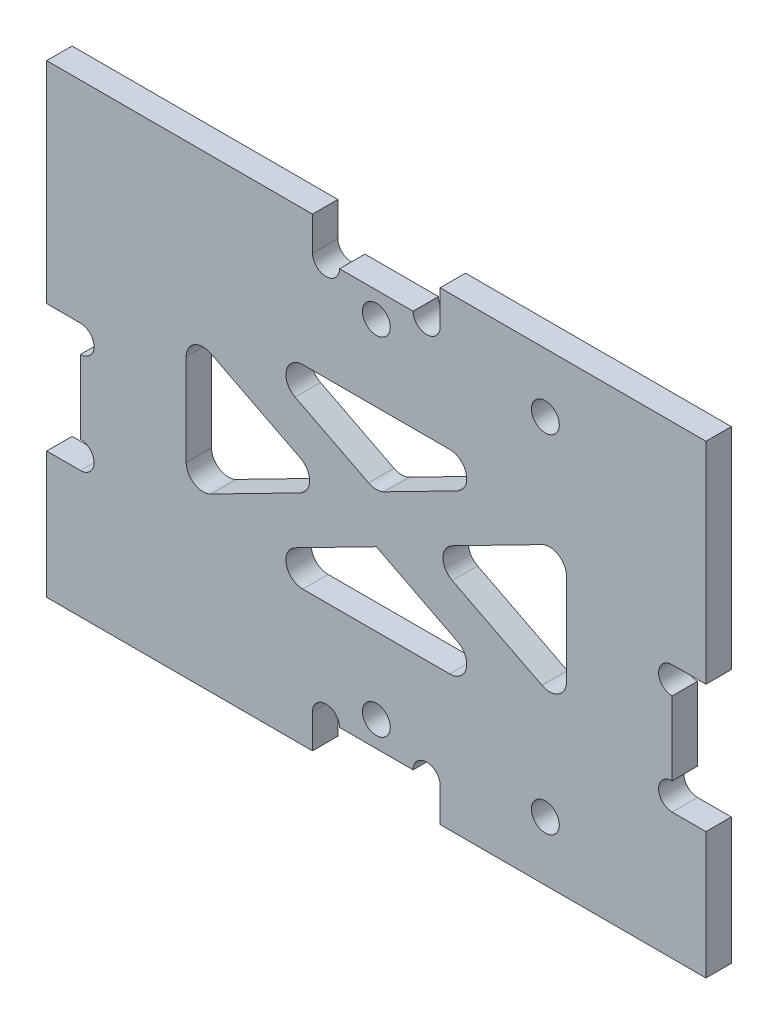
ISO-10303-21;
HEADER;
FILE_DESCRIPTION(('STEP AP214'),'2;1');
FILE_NAME('part.step','',(''),(''),'','','');
FILE_SCHEMA(('AUTOMOTIVE_DESIGN { 1 0 10303 214 1 1 1 1 }'));
ENDSEC;
DATA;
#1=APPLICATION_CONTEXT('core data for automotive mechanical design processes');
#2=APPLICATION_PROTOCOL_DEFINITION('international standard','automotive_design',2000,#1);
#3=PRODUCT_CONTEXT('',#1,'mechanical');
#4=PRODUCT('Part','Part','',(#3));
#5=PRODUCT_RELATED_PRODUCT_CATEGORY('part','',(#4));
#6=PRODUCT_DEFINITION_FORMATION('','',#4);
#7=PRODUCT_DEFINITION_CONTEXT('part definition',#1,'design');
#8=PRODUCT_DEFINITION('design','',#6,#7);
#9=PRODUCT_DEFINITION_SHAPE('','',#8);
#10=(LENGTH_UNIT() NAMED_UNIT(*) SI_UNIT(.MILLI.,.METRE.));
#11=(NAMED_UNIT(*) PLANE_ANGLE_UNIT() SI_UNIT($,.RADIAN.));
#12=(NAMED_UNIT(*) SI_UNIT($,.STERADIAN.) SOLID_ANGLE_UNIT());
#13=UNCERTAINTY_MEASURE_WITH_UNIT(LENGTH_MEASURE(1.E-05),#10,'distance_accuracy_value','');
#14=(GEOMETRIC_REPRESENTATION_CONTEXT(3) GLOBAL_UNCERTAINTY_ASSIGNED_CONTEXT((#13)) GLOBAL_UNIT_ASSIGNED_CONTEXT((#10,
#11,#12)) REPRESENTATION_CONTEXT('',''));
#15=CARTESIAN_POINT('',(0.,0.,0.));
#16=DIRECTION('',(0.,0.,1.));
#17=DIRECTION('',(1.,0.,0.));
#18=AXIS2_PLACEMENT_3D('',#15,#16,#17);
#19=CARTESIAN_POINT('',(35.,-10.9,-7.));
#20=DIRECTION('',(0.,0.,1.));
#21=DIRECTION('',(1.,0.,0.));
#22=AXIS2_PLACEMENT_3D('',#19,#20,#21);
#23=CYLINDRICAL_SURFACE('',#22,1.6);
#24=CARTESIAN_POINT('',(35.,-10.9,0.));
#25=DIRECTION('',(0.,0.,1.));
#26=DIRECTION('',(1.,0.,0.));
#27=AXIS2_PLACEMENT_3D('',#24,#25,#26);
#28=CIRCLE('',#27,1.6);
#29=CARTESIAN_POINT('',(35.,-9.3,0.));
#30=VERTEX_POINT('',#29);
#31=CARTESIAN_POINT('',(35.,-12.5,0.));
#32=VERTEX_POINT('',#31);
#33=EDGE_CURVE('E641',#30,#32,#28,.T.);
#34=ORIENTED_EDGE('',*,*,#33,.F.);
#35=DIRECTION('',(0.,0.,-1.));
#36=VECTOR('',#35,1.);
#37=CARTESIAN_POINT('',(35.,-9.3,-7.));
#38=LINE('',#37,#36);
#39=CARTESIAN_POINT('',(35.,-9.3,3.));
#40=VERTEX_POINT('',#39);
#41=EDGE_CURVE('E420',#40,#30,#38,.T.);
#42=ORIENTED_EDGE('',*,*,#41,.F.);
#43=CARTESIAN_POINT('',(35.,-10.9,3.));
#44=DIRECTION('',(0.,0.,1.));
#45=DIRECTION('',(1.,0.,0.));
#46=AXIS2_PLACEMENT_3D('',#43,#44,#45);
#47=CIRCLE('',#46,1.6);
#48=CARTESIAN_POINT('',(35.,-12.5,3.));
#49=VERTEX_POINT('',#48);
#50=EDGE_CURVE('E560',#40,#49,#47,.T.);
#51=ORIENTED_EDGE('',*,*,#50,.T.);
#52=DIRECTION('',(0.,0.,-1.));
#53=VECTOR('',#52,1.);
#54=CARTESIAN_POINT('',(35.,-12.5,3.));
#55=LINE('',#54,#53);
#56=EDGE_CURVE('E416',#49,#32,#55,.T.);
#57=ORIENTED_EDGE('',*,*,#56,.T.);
#58=EDGE_LOOP('',(#34,#42,#51,#57));
#59=FACE_BOUND('',#58,.T.);
#60=ADVANCED_FACE('F17',(#59),#23,.F.);
#61=CARTESIAN_POINT('',(35.,1.,-7.));
#62=DIRECTION('',(0.,0.,1.));
#63=DIRECTION('',(1.,0.,0.));
#64=AXIS2_PLACEMENT_3D('',#61,#62,#63);
#65=CYLINDRICAL_SURFACE('',#64,1.6);
#66=CARTESIAN_POINT('',(35.,1.,0.));
#67=DIRECTION('',(0.,0.,1.));
#68=DIRECTION('',(1.,0.,0.));
#69=AXIS2_PLACEMENT_3D('',#66,#67,#68);
#70=CIRCLE('',#69,1.6);
#71=CARTESIAN_POINT('',(35.,2.6,0.));
#72=VERTEX_POINT('',#71);
#73=CARTESIAN_POINT('',(35.,-0.6,0.));
#74=VERTEX_POINT('',#73);
#75=EDGE_CURVE('E660',#72,#74,#70,.T.);
#76=ORIENTED_EDGE('',*,*,#75,.F.);
#77=DIRECTION('',(0.,0.,-1.));
#78=VECTOR('',#77,1.);
#79=CARTESIAN_POINT('',(35.,2.6,3.));
#80=LINE('',#79,#78);
#81=CARTESIAN_POINT('',(35.,2.6,3.));
#82=VERTEX_POINT('',#81);
#83=EDGE_CURVE('E425',#82,#72,#80,.T.);
#84=ORIENTED_EDGE('',*,*,#83,.F.);
#85=CARTESIAN_POINT('',(35.,1.,3.));
#86=DIRECTION('',(0.,0.,1.));
#87=DIRECTION('',(1.,0.,0.));
#88=AXIS2_PLACEMENT_3D('',#85,#86,#87);
#89=CIRCLE('',#88,1.6);
#90=CARTESIAN_POINT('',(35.,-0.6,3.));
#91=VERTEX_POINT('',#90);
#92=EDGE_CURVE('E580',#82,#91,#89,.T.);
#93=ORIENTED_EDGE('',*,*,#92,.T.);
#94=DIRECTION('',(0.,0.,1.));
#95=VECTOR('',#94,1.);
#96=CARTESIAN_POINT('',(35.,-0.6,-7.));
#97=LINE('',#96,#95);
#98=EDGE_CURVE('E426',#74,#91,#97,.T.);
#99=ORIENTED_EDGE('',*,*,#98,.F.);
#100=EDGE_LOOP('',(#76,#84,#93,#99));
#101=FACE_BOUND('',#100,.T.);
#102=ADVANCED_FACE('F1760',(#101),#65,.F.);
#103=CARTESIAN_POINT('',(5.95,23.5,-7.));
#104=DIRECTION('',(0.,0.,1.));
#105=DIRECTION('',(1.,0.,0.));
#106=AXIS2_PLACEMENT_3D('',#103,#104,#105);
#107=CYLINDRICAL_SURFACE('',#106,1.6);
#108=DIRECTION('',(0.,0.,1.));
#109=VECTOR('',#108,1.);
#110=CARTESIAN_POINT('',(4.35,23.5,-7.));
#111=LINE('',#110,#109);
#112=CARTESIAN_POINT('',(4.35,23.5,0.));
#113=VERTEX_POINT('',#112);
#114=CARTESIAN_POINT('',(4.35,23.5,3.));
#115=VERTEX_POINT('',#114);
#116=EDGE_CURVE('E433',#113,#115,#111,.T.);
#117=ORIENTED_EDGE('',*,*,#116,.T.);
#118=CARTESIAN_POINT('',(5.95,23.5,3.));
#119=DIRECTION('',(0.,0.,1.));
#120=DIRECTION('',(1.,0.,0.));
#121=AXIS2_PLACEMENT_3D('',#118,#119,#120);
#122=CIRCLE('',#121,1.6);
#123=CARTESIAN_POINT('',(7.55,23.5,3.));
#124=VERTEX_POINT('',#123);
#125=EDGE_CURVE('E895',#115,#124,#122,.T.);
#126=ORIENTED_EDGE('',*,*,#125,.T.);
#127=DIRECTION('',(0.,0.,-1.));
#128=VECTOR('',#127,1.);
#129=CARTESIAN_POINT('',(7.55,23.5,3.));
#130=LINE('',#129,#128);
#131=CARTESIAN_POINT('',(7.55,23.5,0.));
#132=VERTEX_POINT('',#131);
#133=EDGE_CURVE('E430',#124,#132,#130,.T.);
#134=ORIENTED_EDGE('',*,*,#133,.T.);
#135=CARTESIAN_POINT('',(5.95,23.5,0.));
#136=DIRECTION('',(0.,0.,1.));
#137=DIRECTION('',(1.,0.,0.));
#138=AXIS2_PLACEMENT_3D('',#135,#136,#137);
#139=CIRCLE('',#138,1.6);
#140=EDGE_CURVE('E624',#113,#132,#139,.T.);
#141=ORIENTED_EDGE('',*,*,#140,.F.);
#142=EDGE_LOOP('',(#117,#126,#134,#141));
#143=FACE_BOUND('',#142,.T.);
#144=ADVANCED_FACE('F1699',(#143),#107,.F.);
#145=CARTESIAN_POINT('',(-5.95,23.5,-7.));
#146=DIRECTION('',(0.,0.,1.));
#147=DIRECTION('',(1.,0.,0.));
#148=AXIS2_PLACEMENT_3D('',#145,#146,#147);
#149=CYLINDRICAL_SURFACE('',#148,1.6);
#150=DIRECTION('',(0.,0.,-1.));
#151=VECTOR('',#150,1.);
#152=CARTESIAN_POINT('',(-4.35,23.5,-7.));
#153=LINE('',#152,#151);
#154=CARTESIAN_POINT('',(-4.35,23.5,3.));
#155=VERTEX_POINT('',#154);
#156=CARTESIAN_POINT('',(-4.35,23.5,0.));
#157=VERTEX_POINT('',#156);
#158=EDGE_CURVE('E438',#155,#157,#153,.T.);
#159=ORIENTED_EDGE('',*,*,#158,.T.);
#160=CARTESIAN_POINT('',(-5.95,23.5,0.));
#161=DIRECTION('',(0.,0.,1.));
#162=DIRECTION('',(1.,0.,0.));
#163=AXIS2_PLACEMENT_3D('',#160,#161,#162);
#164=CIRCLE('',#163,1.6);
#165=CARTESIAN_POINT('',(-7.55,23.5,0.));
#166=VERTEX_POINT('',#165);
#167=EDGE_CURVE('E704',#166,#157,#164,.T.);
#168=ORIENTED_EDGE('',*,*,#167,.F.);
#169=DIRECTION('',(0.,0.,-1.));
#170=VECTOR('',#169,1.);
#171=CARTESIAN_POINT('',(-7.55,23.5,3.));
#172=LINE('',#171,#170);
#173=CARTESIAN_POINT('',(-7.55,23.5,3.));
#174=VERTEX_POINT('',#173);
#175=EDGE_CURVE('E444',#174,#166,#172,.T.);
#176=ORIENTED_EDGE('',*,*,#175,.F.);
#177=CARTESIAN_POINT('',(-5.95,23.5,3.));
#178=DIRECTION('',(0.,0.,1.));
#179=DIRECTION('',(1.,0.,0.));
#180=AXIS2_PLACEMENT_3D('',#177,#178,#179);
#181=CIRCLE('',#180,1.6);
#182=EDGE_CURVE('E903',#174,#155,#181,.T.);
#183=ORIENTED_EDGE('',*,*,#182,.T.);
#184=EDGE_LOOP('',(#159,#168,#176,#183));
#185=FACE_BOUND('',#184,.T.);
#186=ADVANCED_FACE('F1707',(#185),#149,.F.);
#187=CARTESIAN_POINT('',(-5.95,-23.5,-7.));
#188=DIRECTION('',(0.,0.,1.));
#189=DIRECTION('',(1.,0.,0.));
#190=AXIS2_PLACEMENT_3D('',#187,#188,#189);
#191=CYLINDRICAL_SURFACE('',#190,1.6);
#192=CARTESIAN_POINT('',(-5.95,-23.5,0.));
#193=DIRECTION('',(0.,0.,1.));
#194=DIRECTION('',(1.,0.,0.));
#195=AXIS2_PLACEMENT_3D('',#192,#193,#194);
#196=CIRCLE('',#195,1.6);
#197=CARTESIAN_POINT('',(-4.35,-23.5,0.));
#198=VERTEX_POINT('',#197);
#199=CARTESIAN_POINT('',(-7.55,-23.5,0.));
#200=VERTEX_POINT('',#199);
#201=EDGE_CURVE('E681',#198,#200,#196,.T.);
#202=ORIENTED_EDGE('',*,*,#201,.F.);
#203=DIRECTION('',(0.,0.,-1.));
#204=VECTOR('',#203,1.);
#205=CARTESIAN_POINT('',(-4.35,-23.5,-7.));
#206=LINE('',#205,#204);
#207=CARTESIAN_POINT('',(-4.35,-23.5,3.));
#208=VERTEX_POINT('',#207);
#209=EDGE_CURVE('E474',#208,#198,#206,.T.);
#210=ORIENTED_EDGE('',*,*,#209,.F.);
#211=CARTESIAN_POINT('',(-5.95,-23.5,3.));
#212=DIRECTION('',(0.,0.,1.));
#213=DIRECTION('',(1.,0.,0.));
#214=AXIS2_PLACEMENT_3D('',#211,#212,#213);
#215=CIRCLE('',#214,1.6);
#216=CARTESIAN_POINT('',(-7.55,-23.5,3.));
#217=VERTEX_POINT('',#216);
#218=EDGE_CURVE('E935',#208,#217,#215,.T.);
#219=ORIENTED_EDGE('',*,*,#218,.T.);
#220=DIRECTION('',(0.,0.,-1.));
#221=VECTOR('',#220,1.);
#222=CARTESIAN_POINT('',(-7.55,-23.5,3.));
#223=LINE('',#222,#221);
#224=EDGE_CURVE('E468',#217,#200,#223,.T.);
#225=ORIENTED_EDGE('',*,*,#224,.T.);
#226=EDGE_LOOP('',(#202,#210,#219,#225));
#227=FACE_BOUND('',#226,.T.);
#228=ADVANCED_FACE('F1747',(#227),#191,.F.);
#229=CARTESIAN_POINT('',(5.95,-23.5,-7.));
#230=DIRECTION('',(0.,0.,1.));
#231=DIRECTION('',(1.,0.,0.));
#232=AXIS2_PLACEMENT_3D('',#229,#230,#231);
#233=CYLINDRICAL_SURFACE('',#232,1.6);
#234=CARTESIAN_POINT('',(5.95,-23.5,0.));
#235=DIRECTION('',(0.,0.,1.));
#236=DIRECTION('',(1.,0.,0.));
#237=AXIS2_PLACEMENT_3D('',#234,#235,#236);
#238=CIRCLE('',#237,1.6);
#239=CARTESIAN_POINT('',(7.55,-23.5,0.));
#240=VERTEX_POINT('',#239);
#241=CARTESIAN_POINT('',(4.35,-23.5,0.));
#242=VERTEX_POINT('',#241);
#243=EDGE_CURVE('E672',#240,#242,#238,.T.);
#244=ORIENTED_EDGE('',*,*,#243,.F.);
#245=DIRECTION('',(0.,0.,-1.));
#246=VECTOR('',#245,1.);
#247=CARTESIAN_POINT('',(7.55,-23.5,3.));
#248=LINE('',#247,#246);
#249=CARTESIAN_POINT('',(7.55,-23.5,3.));
#250=VERTEX_POINT('',#249);
#251=EDGE_CURVE('E366',#250,#240,#248,.T.);
#252=ORIENTED_EDGE('',*,*,#251,.F.);
#253=CARTESIAN_POINT('',(5.95,-23.5,3.));
#254=DIRECTION('',(0.,0.,1.));
#255=DIRECTION('',(1.,0.,0.));
#256=AXIS2_PLACEMENT_3D('',#253,#254,#255);
#257=CIRCLE('',#256,1.6);
#258=CARTESIAN_POINT('',(4.35,-23.5,3.));
#259=VERTEX_POINT('',#258);
#260=EDGE_CURVE('E550',#250,#259,#257,.T.);
#261=ORIENTED_EDGE('',*,*,#260,.T.);
#262=DIRECTION('',(0.,0.,1.));
#263=VECTOR('',#262,1.);
#264=CARTESIAN_POINT('',(4.35,-23.5,-7.));
#265=LINE('',#264,#263);
#266=EDGE_CURVE('E471',#242,#259,#265,.T.);
#267=ORIENTED_EDGE('',*,*,#266,.F.);
#268=EDGE_LOOP('',(#244,#252,#261,#267));
#269=FACE_BOUND('',#268,.T.);
#270=ADVANCED_FACE('F1077',(#269),#233,.F.);
#271=CARTESIAN_POINT('',(-20.5,-5.42406627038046,0.));
#272=DIRECTION('',(0.,0.,-1.));
#273=DIRECTION('',(-1.,0.,0.));
#274=AXIS2_PLACEMENT_3D('',#271,#272,#273);
#275=CYLINDRICAL_SURFACE('',#274,2.);
#276=CARTESIAN_POINT('',(-20.5,-5.42406627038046,3.));
#277=DIRECTION('',(0.,0.,-1.));
#278=DIRECTION('',(1.,0.,0.));
#279=AXIS2_PLACEMENT_3D('',#276,#277,#278);
#280=CIRCLE('',#279,2.);
#281=CARTESIAN_POINT('',(-19.5897778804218,-7.20493563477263,3.));
#282=VERTEX_POINT('',#281);
#283=CARTESIAN_POINT('',(-22.5,-5.42406627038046,3.));
#284=VERTEX_POINT('',#283);
#285=EDGE_CURVE('E605',#282,#284,#280,.T.);
#286=ORIENTED_EDGE('',*,*,#285,.F.);
#287=DIRECTION('',(0.,0.,1.));
#288=VECTOR('',#287,1.);
#289=CARTESIAN_POINT('',(-19.5897778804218,-7.20493563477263,0.));
#290=LINE('',#289,#288);
#291=CARTESIAN_POINT('',(-19.5897778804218,-7.20493563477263,0.));
#292=VERTEX_POINT('',#291);
#293=EDGE_CURVE('E11',#292,#282,#290,.T.);
#294=ORIENTED_EDGE('',*,*,#293,.F.);
#295=CARTESIAN_POINT('',(-20.5,-5.42406627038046,0.));
#296=DIRECTION('',(0.,0.,1.));
#297=DIRECTION('',(1.,0.,0.));
#298=AXIS2_PLACEMENT_3D('',#295,#296,#297);
#299=CIRCLE('',#298,2.);
#300=CARTESIAN_POINT('',(-22.5,-5.42406627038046,0.));
#301=VERTEX_POINT('',#300);
#302=EDGE_CURVE('E716',#301,#292,#299,.T.);
#303=ORIENTED_EDGE('',*,*,#302,.F.);
#304=DIRECTION('',(0.,0.,-1.));
#305=VECTOR('',#304,1.);
#306=CARTESIAN_POINT('',(-22.5,-5.42406627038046,0.));
#307=LINE('',#306,#305);
#308=EDGE_CURVE('E889',#284,#301,#307,.T.);
#309=ORIENTED_EDGE('',*,*,#308,.F.);
#310=EDGE_LOOP('',(#286,#294,#303,#309));
#311=FACE_BOUND('',#310,.T.);
#312=ADVANCED_FACE('F1834',(#311),#275,.F.);
#313=CARTESIAN_POINT('',(-20.5,5.42406627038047,0.));
#314=DIRECTION('',(0.,0.,1.));
#315=DIRECTION('',(1.,0.,0.));
#316=AXIS2_PLACEMENT_3D('',#313,#314,#315);
#317=CYLINDRICAL_SURFACE('',#316,2.);
#318=CARTESIAN_POINT('',(-20.5,5.42406627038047,3.));
#319=DIRECTION('',(0.,0.,-1.));
#320=DIRECTION('',(1.,0.,0.));
#321=AXIS2_PLACEMENT_3D('',#318,#319,#320);
#322=CIRCLE('',#321,2.);
#323=CARTESIAN_POINT('',(-22.5,5.42406627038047,3.));
#324=VERTEX_POINT('',#323);
#325=CARTESIAN_POINT('',(-19.5897778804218,7.20493563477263,3.));
#326=VERTEX_POINT('',#325);
#327=EDGE_CURVE('E600',#324,#326,#322,.T.);
#328=ORIENTED_EDGE('',*,*,#327,.F.);
#329=DIRECTION('',(0.,0.,1.));
#330=VECTOR('',#329,1.);
#331=CARTESIAN_POINT('',(-22.5,5.42406627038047,3.));
#332=LINE('',#331,#330);
#333=CARTESIAN_POINT('',(-22.5,5.42406627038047,0.));
#334=VERTEX_POINT('',#333);
#335=EDGE_CURVE('E871',#334,#324,#332,.T.);
#336=ORIENTED_EDGE('',*,*,#335,.F.);
#337=CARTESIAN_POINT('',(-20.5,5.42406627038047,0.));
#338=DIRECTION('',(0.,0.,1.));
#339=DIRECTION('',(1.,0.,0.));
#340=AXIS2_PLACEMENT_3D('',#337,#338,#339);
#341=CIRCLE('',#340,2.);
#342=CARTESIAN_POINT('',(-19.5897778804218,7.20493563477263,0.));
#343=VERTEX_POINT('',#342);
#344=EDGE_CURVE('E713',#343,#334,#341,.T.);
#345=ORIENTED_EDGE('',*,*,#344,.F.);
#346=DIRECTION('',(0.,0.,-1.));
#347=VECTOR('',#346,1.);
#348=CARTESIAN_POINT('',(-19.5897778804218,7.20493563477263,0.));
#349=LINE('',#348,#347);
#350=EDGE_CURVE('E505',#326,#343,#349,.T.);
#351=ORIENTED_EDGE('',*,*,#350,.F.);
#352=EDGE_LOOP('',(#328,#336,#345,#351));
#353=FACE_BOUND('',#352,.T.);
#354=ADVANCED_FACE('F1837',(#353),#317,.F.);
#355=CARTESIAN_POINT('',(0.,5.05371150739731,0.));
#356=DIRECTION('',(0.,0.,-1.));
#357=DIRECTION('',(-1.,0.,0.));
#358=AXIS2_PLACEMENT_3D('',#355,#356,#357);
#359=CYLINDRICAL_SURFACE('',#358,2.);
#360=CARTESIAN_POINT('',(0.,5.05371150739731,0.));
#361=DIRECTION('',(0.,0.,1.));
#362=DIRECTION('',(1.,0.,0.));
#363=AXIS2_PLACEMENT_3D('',#360,#361,#362);
#364=CIRCLE('',#363,2.);
#365=CARTESIAN_POINT('',(-0.910222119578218,3.27284214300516,0.));
#366=VERTEX_POINT('',#365);
#367=CARTESIAN_POINT('',(0.910222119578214,3.27284214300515,0.));
#368=VERTEX_POINT('',#367);
#369=EDGE_CURVE('E575',#366,#368,#364,.T.);
#370=ORIENTED_EDGE('',*,*,#369,.F.);
#371=DIRECTION('',(0.,0.,-1.));
#372=VECTOR('',#371,1.);
#373=CARTESIAN_POINT('',(-0.910222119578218,3.27284214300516,0.));
#374=LINE('',#373,#372);
#375=CARTESIAN_POINT('',(-0.910222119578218,3.27284214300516,3.));
#376=VERTEX_POINT('',#375);
#377=EDGE_CURVE('E508',#376,#366,#374,.T.);
#378=ORIENTED_EDGE('',*,*,#377,.F.);
#379=CARTESIAN_POINT('',(0.,5.05371150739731,3.));
#380=DIRECTION('',(0.,0.,-1.));
#381=DIRECTION('',(1.,0.,0.));
#382=AXIS2_PLACEMENT_3D('',#379,#380,#381);
#383=CIRCLE('',#382,2.);
#384=CARTESIAN_POINT('',(0.910222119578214,3.27284214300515,3.));
#385=VERTEX_POINT('',#384);
#386=EDGE_CURVE('E613',#385,#376,#383,.T.);
#387=ORIENTED_EDGE('',*,*,#386,.F.);
#388=DIRECTION('',(0.,0.,1.));
#389=VECTOR('',#388,1.);
#390=CARTESIAN_POINT('',(0.910222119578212,3.27284214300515,3.));
#391=LINE('',#390,#389);
#392=EDGE_CURVE('E518',#368,#385,#391,.T.);
#393=ORIENTED_EDGE('',*,*,#392,.F.);
#394=EDGE_LOOP('',(#370,#378,#387,#393));
#395=FACE_BOUND('',#394,.T.);
#396=ADVANCED_FACE('F1050',(#395),#359,.F.);
#397=CARTESIAN_POINT('',(-8.69926009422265,-9.5,0.));
#398=DIRECTION('',(0.,0.,1.));
#399=DIRECTION('',(1.,0.,0.));
#400=AXIS2_PLACEMENT_3D('',#397,#398,#399);
#401=CYLINDRICAL_SURFACE('',#400,2.);
#402=CARTESIAN_POINT('',(-8.69926009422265,-9.5,0.));
#403=DIRECTION('',(0.,0.,1.));
#404=DIRECTION('',(1.,0.,0.));
#405=AXIS2_PLACEMENT_3D('',#402,#403,#404);
#406=CIRCLE('',#405,2.);
#407=CARTESIAN_POINT('',(-9.60948221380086,-7.71913063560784,0.));
#408=VERTEX_POINT('',#407);
#409=CARTESIAN_POINT('',(-8.69926009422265,-11.5,0.));
#410=VERTEX_POINT('',#409);
#411=EDGE_CURVE('E382',#408,#410,#406,.T.);
#412=ORIENTED_EDGE('',*,*,#411,.F.);
#413=DIRECTION('',(0.,0.,-1.));
#414=VECTOR('',#413,1.);
#415=CARTESIAN_POINT('',(-9.60948221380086,-7.71913063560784,0.));
#416=LINE('',#415,#414);
#417=CARTESIAN_POINT('',(-9.60948221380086,-7.71913063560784,3.));
#418=VERTEX_POINT('',#417);
#419=EDGE_CURVE('E501',#418,#408,#416,.T.);
#420=ORIENTED_EDGE('',*,*,#419,.F.);
#421=CARTESIAN_POINT('',(-8.69926009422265,-9.5,3.));
#422=DIRECTION('',(0.,0.,-1.));
#423=DIRECTION('',(1.,0.,0.));
#424=AXIS2_PLACEMENT_3D('',#421,#422,#423);
#425=CIRCLE('',#424,2.);
#426=CARTESIAN_POINT('',(-8.69926009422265,-11.5,3.));
#427=VERTEX_POINT('',#426);
#428=EDGE_CURVE('E634',#427,#418,#425,.T.);
#429=ORIENTED_EDGE('',*,*,#428,.F.);
#430=DIRECTION('',(0.,0.,1.));
#431=VECTOR('',#430,1.);
#432=CARTESIAN_POINT('',(-8.69926009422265,-11.5,0.));
#433=LINE('',#432,#431);
#434=EDGE_CURVE('E365',#410,#427,#433,.T.);
#435=ORIENTED_EDGE('',*,*,#434,.F.);
#436=EDGE_LOOP('',(#412,#420,#429,#435));
#437=FACE_BOUND('',#436,.T.);
#438=ADVANCED_FACE('F1809',(#437),#401,.F.);
#439=CARTESIAN_POINT('',(8.69926009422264,-9.5,0.));
#440=DIRECTION('',(0.,0.,-1.));
#441=DIRECTION('',(-1.,0.,0.));
#442=AXIS2_PLACEMENT_3D('',#439,#440,#441);
#443=CYLINDRICAL_SURFACE('',#442,2.);
#444=CARTESIAN_POINT('',(8.69926009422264,-9.5,3.));
#445=DIRECTION('',(0.,0.,-1.));
#446=DIRECTION('',(1.,0.,0.));
#447=AXIS2_PLACEMENT_3D('',#444,#445,#446);
#448=CIRCLE('',#447,2.);
#449=CARTESIAN_POINT('',(9.60948221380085,-7.71913063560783,3.));
#450=VERTEX_POINT('',#449);
#451=CARTESIAN_POINT('',(8.69926009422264,-11.5,3.));
#452=VERTEX_POINT('',#451);
#453=EDGE_CURVE('E631',#450,#452,#448,.T.);
#454=ORIENTED_EDGE('',*,*,#453,.F.);
#455=DIRECTION('',(0.,0.,1.));
#456=VECTOR('',#455,1.);
#457=CARTESIAN_POINT('',(9.60948221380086,-7.71913063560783,0.));
#458=LINE('',#457,#456);
#459=CARTESIAN_POINT('',(9.60948221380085,-7.71913063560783,0.));
#460=VERTEX_POINT('',#459);
#461=EDGE_CURVE('E371',#460,#450,#458,.T.);
#462=ORIENTED_EDGE('',*,*,#461,.F.);
#463=CARTESIAN_POINT('',(8.69926009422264,-9.5,0.));
#464=DIRECTION('',(0.,0.,1.));
#465=DIRECTION('',(1.,0.,0.));
#466=AXIS2_PLACEMENT_3D('',#463,#464,#465);
#467=CIRCLE('',#466,2.);
#468=CARTESIAN_POINT('',(8.69926009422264,-11.5,0.));
#469=VERTEX_POINT('',#468);
#470=EDGE_CURVE('E369',#469,#460,#467,.T.);
#471=ORIENTED_EDGE('',*,*,#470,.F.);
#472=DIRECTION('',(0.,0.,-1.));
#473=VECTOR('',#472,1.);
#474=CARTESIAN_POINT('',(8.69926009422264,-11.5,0.));
#475=LINE('',#474,#473);
#476=EDGE_CURVE('E353',#452,#469,#475,.T.);
#477=ORIENTED_EDGE('',*,*,#476,.F.);
#478=EDGE_LOOP('',(#454,#462,#471,#477));
#479=FACE_BOUND('',#478,.T.);
#480=ADVANCED_FACE('F370',(#479),#443,.F.);
#481=CARTESIAN_POINT('',(20.5,-5.42406627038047,0.));
#482=DIRECTION('',(0.,0.,1.));
#483=DIRECTION('',(1.,0.,0.));
#484=AXIS2_PLACEMENT_3D('',#481,#482,#483);
#485=CYLINDRICAL_SURFACE('',#484,2.);
#486=CARTESIAN_POINT('',(20.5,-5.42406627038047,3.));
#487=DIRECTION('',(0.,0.,-1.));
#488=DIRECTION('',(1.,0.,0.));
#489=AXIS2_PLACEMENT_3D('',#486,#487,#488);
#490=CIRCLE('',#489,2.);
#491=CARTESIAN_POINT('',(22.5,-5.42406627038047,3.));
#492=VERTEX_POINT('',#491);
#493=CARTESIAN_POINT('',(19.5897778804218,-7.20493563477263,3.));
#494=VERTEX_POINT('',#493);
#495=EDGE_CURVE('E649',#492,#494,#490,.T.);
#496=ORIENTED_EDGE('',*,*,#495,.F.);
#497=DIRECTION('',(0.,0.,1.));
#498=VECTOR('',#497,1.);
#499=CARTESIAN_POINT('',(22.5,-5.42406627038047,3.));
#500=LINE('',#499,#498);
#501=CARTESIAN_POINT('',(22.5,-5.42406627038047,0.));
#502=VERTEX_POINT('',#501);
#503=EDGE_CURVE('E857',#502,#492,#500,.T.);
#504=ORIENTED_EDGE('',*,*,#503,.F.);
#505=CARTESIAN_POINT('',(20.5,-5.42406627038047,0.));
#506=DIRECTION('',(0.,0.,1.));
#507=DIRECTION('',(1.,0.,0.));
#508=AXIS2_PLACEMENT_3D('',#505,#506,#507);
#509=CIRCLE('',#508,2.);
#510=CARTESIAN_POINT('',(19.5897778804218,-7.20493563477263,0.));
#511=VERTEX_POINT('',#510);
#512=EDGE_CURVE('E397',#511,#502,#509,.T.);
#513=ORIENTED_EDGE('',*,*,#512,.F.);
#514=DIRECTION('',(0.,0.,-1.));
#515=VECTOR('',#514,1.);
#516=CARTESIAN_POINT('',(19.5897778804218,-7.20493563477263,0.));
#517=LINE('',#516,#515);
#518=EDGE_CURVE('E488',#494,#511,#517,.T.);
#519=ORIENTED_EDGE('',*,*,#518,.F.);
#520=EDGE_LOOP('',(#496,#504,#513,#519));
#521=FACE_BOUND('',#520,.T.);
#522=ADVANCED_FACE('F1808',(#521),#485,.F.);
#523=CARTESIAN_POINT('',(20.5,5.42406627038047,0.));
#524=DIRECTION('',(0.,0.,-1.));
#525=DIRECTION('',(-1.,0.,0.));
#526=AXIS2_PLACEMENT_3D('',#523,#524,#525);
#527=CYLINDRICAL_SURFACE('',#526,2.);
#528=CARTESIAN_POINT('',(20.5,5.42406627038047,3.));
#529=DIRECTION('',(0.,0.,-1.));
#530=DIRECTION('',(1.,0.,0.));
#531=AXIS2_PLACEMENT_3D('',#528,#529,#530);
#532=CIRCLE('',#531,2.);
#533=CARTESIAN_POINT('',(19.5897778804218,7.20493563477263,3.));
#534=VERTEX_POINT('',#533);
#535=CARTESIAN_POINT('',(22.5,5.42406627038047,3.));
#536=VERTEX_POINT('',#535);
#537=EDGE_CURVE('E654',#534,#536,#532,.T.);
#538=ORIENTED_EDGE('',*,*,#537,.F.);
#539=DIRECTION('',(0.,0.,1.));
#540=VECTOR('',#539,1.);
#541=CARTESIAN_POINT('',(19.5897778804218,7.20493563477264,0.));
#542=LINE('',#541,#540);
#543=CARTESIAN_POINT('',(19.5897778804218,7.20493563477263,0.));
#544=VERTEX_POINT('',#543);
#545=EDGE_CURVE('E493',#544,#534,#542,.T.);
#546=ORIENTED_EDGE('',*,*,#545,.F.);
#547=CARTESIAN_POINT('',(20.5,5.42406627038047,0.));
#548=DIRECTION('',(0.,0.,1.));
#549=DIRECTION('',(1.,0.,0.));
#550=AXIS2_PLACEMENT_3D('',#547,#548,#549);
#551=CIRCLE('',#550,2.);
#552=CARTESIAN_POINT('',(22.5,5.42406627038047,0.));
#553=VERTEX_POINT('',#552);
#554=EDGE_CURVE('E402',#553,#544,#551,.T.);
#555=ORIENTED_EDGE('',*,*,#554,.F.);
#556=DIRECTION('',(0.,0.,-1.));
#557=VECTOR('',#556,1.);
#558=CARTESIAN_POINT('',(22.5,5.42406627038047,0.));
#559=LINE('',#558,#557);
#560=EDGE_CURVE('E858',#536,#553,#559,.T.);
#561=ORIENTED_EDGE('',*,*,#560,.F.);
#562=EDGE_LOOP('',(#538,#546,#555,#561));
#563=FACE_BOUND('',#562,.T.);
#564=ADVANCED_FACE('F1870',(#563),#527,.F.);
#565=CARTESIAN_POINT('',(9.88769642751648,0.,0.));
#566=DIRECTION('',(0.,0.,1.));
#567=DIRECTION('',(1.,0.,0.));
#568=AXIS2_PLACEMENT_3D('',#565,#566,#567);
#569=CYLINDRICAL_SURFACE('',#568,2.);
#570=CARTESIAN_POINT('',(9.88769642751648,0.,0.));
#571=DIRECTION('',(0.,0.,1.));
#572=DIRECTION('',(1.,0.,0.));
#573=AXIS2_PLACEMENT_3D('',#570,#571,#572);
#574=CIRCLE('',#573,2.);
#575=CARTESIAN_POINT('',(8.97747430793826,1.78086936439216,0.));
#576=VERTEX_POINT('',#575);
#577=CARTESIAN_POINT('',(8.97747430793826,-1.78086936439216,0.));
#578=VERTEX_POINT('',#577);
#579=EDGE_CURVE('E407',#576,#578,#574,.T.);
#580=ORIENTED_EDGE('',*,*,#579,.F.);
#581=DIRECTION('',(0.,0.,-1.));
#582=VECTOR('',#581,1.);
#583=CARTESIAN_POINT('',(8.97747430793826,1.78086936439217,0.));
#584=LINE('',#583,#582);
#585=CARTESIAN_POINT('',(8.97747430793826,1.78086936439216,3.));
#586=VERTEX_POINT('',#585);
#587=EDGE_CURVE('E40',#586,#576,#584,.T.);
#588=ORIENTED_EDGE('',*,*,#587,.F.);
#589=CARTESIAN_POINT('',(9.88769642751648,0.,3.));
#590=DIRECTION('',(0.,0.,-1.));
#591=DIRECTION('',(1.,0.,0.));
#592=AXIS2_PLACEMENT_3D('',#589,#590,#591);
#593=CIRCLE('',#592,2.);
#594=CARTESIAN_POINT('',(8.97747430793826,-1.78086936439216,3.));
#595=VERTEX_POINT('',#594);
#596=EDGE_CURVE('E569',#595,#586,#593,.T.);
#597=ORIENTED_EDGE('',*,*,#596,.F.);
#598=DIRECTION('',(0.,0.,1.));
#599=VECTOR('',#598,1.);
#600=CARTESIAN_POINT('',(8.97747430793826,-1.78086936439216,0.));
#601=LINE('',#600,#599);
#602=EDGE_CURVE('E485',#578,#595,#601,.T.);
#603=ORIENTED_EDGE('',*,*,#602,.F.);
#604=EDGE_LOOP('',(#580,#588,#597,#603));
#605=FACE_BOUND('',#604,.T.);
#606=ADVANCED_FACE('F1848',(#605),#569,.F.);
#607=CARTESIAN_POINT('',(-23.6377776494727,-9.2739132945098,0.));
#608=DIRECTION('',(0.455111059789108,-0.890434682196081,0.));
#609=DIRECTION('',(0.,0.,-1.));
#610=AXIS2_PLACEMENT_3D('',#607,#608,#609);
#611=PLANE('',#610);
#612=DIRECTION('',(0.890434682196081,0.455111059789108,0.));
#613=VECTOR('',#612,1.);
#614=CARTESIAN_POINT('',(-23.6377776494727,-9.2739132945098,3.));
#615=LINE('',#614,#613);
#616=CARTESIAN_POINT('',(-8.97747430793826,-1.78086936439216,3.));
#617=VERTEX_POINT('',#616);
#618=EDGE_CURVE('E609',#282,#617,#615,.T.);
#619=ORIENTED_EDGE('',*,*,#618,.T.);
#620=DIRECTION('',(0.,0.,-1.));
#621=VECTOR('',#620,1.);
#622=CARTESIAN_POINT('',(-8.97747430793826,-1.78086936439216,0.));
#623=LINE('',#622,#621);
#624=CARTESIAN_POINT('',(-8.97747430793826,-1.78086936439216,0.));
#625=VERTEX_POINT('',#624);
#626=EDGE_CURVE('E26',#617,#625,#623,.T.);
#627=ORIENTED_EDGE('',*,*,#626,.T.);
#628=DIRECTION('',(0.890434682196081,0.455111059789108,0.));
#629=VECTOR('',#628,1.);
#630=CARTESIAN_POINT('',(-23.6377776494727,-9.2739132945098,0.));
#631=LINE('',#630,#629);
#632=EDGE_CURVE('E576',#292,#625,#631,.T.);
#633=ORIENTED_EDGE('',*,*,#632,.F.);
#634=ORIENTED_EDGE('',*,*,#293,.T.);
#635=EDGE_LOOP('',(#619,#627,#633,#634));
#636=FACE_BOUND('',#635,.T.);
#637=ADVANCED_FACE('F1845',(#636),#611,.F.);
#638=CARTESIAN_POINT('',(-23.6377776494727,-9.2739132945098,0.));
#639=DIRECTION('',(0.455111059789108,-0.890434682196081,0.));
#640=DIRECTION('',(0.,0.,-1.));
#641=AXIS2_PLACEMENT_3D('',#638,#639,#640);
#642=PLANE('',#641);
#643=DIRECTION('',(0.890434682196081,0.455111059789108,0.));
#644=VECTOR('',#643,1.);
#645=CARTESIAN_POINT('',(-23.6377776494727,-9.2739132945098,3.));
#646=LINE('',#645,#644);
#647=CARTESIAN_POINT('',(9.60948221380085,7.71913063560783,3.));
#648=VERTEX_POINT('',#647);
#649=EDGE_CURVE('E610',#385,#648,#646,.T.);
#650=ORIENTED_EDGE('',*,*,#649,.T.);
#651=DIRECTION('',(0.,0.,-1.));
#652=VECTOR('',#651,1.);
#653=CARTESIAN_POINT('',(9.60948221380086,7.71913063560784,0.));
#654=LINE('',#653,#652);
#655=CARTESIAN_POINT('',(9.60948221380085,7.71913063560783,0.));
#656=VERTEX_POINT('',#655);
#657=EDGE_CURVE('E515',#648,#656,#654,.T.);
#658=ORIENTED_EDGE('',*,*,#657,.T.);
#659=DIRECTION('',(0.890434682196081,0.455111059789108,0.));
#660=VECTOR('',#659,1.);
#661=CARTESIAN_POINT('',(-23.6377776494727,-9.2739132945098,0.));
#662=LINE('',#661,#660);
#663=EDGE_CURVE('E668',#368,#656,#662,.T.);
#664=ORIENTED_EDGE('',*,*,#663,.F.);
#665=ORIENTED_EDGE('',*,*,#392,.T.);
#666=EDGE_LOOP('',(#650,#658,#664,#665));
#667=FACE_BOUND('',#666,.T.);
#668=ADVANCED_FACE('F1052',(#667),#642,.F.);
#669=CARTESIAN_POINT('',(-21.3622223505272,13.7260867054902,0.));
#670=DIRECTION('',(-0.455111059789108,-0.890434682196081,0.));
#671=DIRECTION('',(-0.890434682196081,0.455111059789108,0.));
#672=AXIS2_PLACEMENT_3D('',#669,#670,#671);
#673=PLANE('',#672);
#674=DIRECTION('',(0.890434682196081,-0.455111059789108,0.));
#675=VECTOR('',#674,1.);
#676=CARTESIAN_POINT('',(-21.3622223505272,13.7260867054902,3.));
#677=LINE('',#676,#675);
#678=CARTESIAN_POINT('',(-9.60948221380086,7.71913063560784,3.));
#679=VERTEX_POINT('',#678);
#680=EDGE_CURVE('E614',#679,#376,#677,.T.);
#681=ORIENTED_EDGE('',*,*,#680,.T.);
#682=ORIENTED_EDGE('',*,*,#377,.T.);
#683=DIRECTION('',(0.890434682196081,-0.455111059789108,0.));
#684=VECTOR('',#683,1.);
#685=CARTESIAN_POINT('',(-21.3622223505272,13.7260867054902,0.));
#686=LINE('',#685,#684);
#687=CARTESIAN_POINT('',(-9.60948221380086,7.71913063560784,0.));
#688=VERTEX_POINT('',#687);
#689=EDGE_CURVE('E571',#688,#366,#686,.T.);
#690=ORIENTED_EDGE('',*,*,#689,.F.);
#691=DIRECTION('',(0.,0.,1.));
#692=VECTOR('',#691,1.);
#693=CARTESIAN_POINT('',(-9.60948221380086,7.71913063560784,0.));
#694=LINE('',#693,#692);
#695=EDGE_CURVE('E511',#688,#679,#694,.T.);
#696=ORIENTED_EDGE('',*,*,#695,.T.);
#697=EDGE_LOOP('',(#681,#682,#690,#696));
#698=FACE_BOUND('',#697,.T.);
#699=ADVANCED_FACE('F1047',(#698),#673,.F.);
#700=CARTESIAN_POINT('',(-23.6377776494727,9.2739132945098,0.));
#701=DIRECTION('',(-0.455111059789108,-0.890434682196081,0.));
#702=DIRECTION('',(-0.890434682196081,0.455111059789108,0.));
#703=AXIS2_PLACEMENT_3D('',#700,#701,#702);
#704=PLANE('',#703);
#705=DIRECTION('',(0.890434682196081,-0.455111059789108,0.));
#706=VECTOR('',#705,1.);
#707=CARTESIAN_POINT('',(-23.6377776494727,9.2739132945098,0.));
#708=LINE('',#707,#706);
#709=CARTESIAN_POINT('',(-8.97747430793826,1.78086936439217,0.));
#710=VERTEX_POINT('',#709);
#711=EDGE_CURVE('E709',#343,#710,#708,.T.);
#712=ORIENTED_EDGE('',*,*,#711,.T.);
#713=DIRECTION('',(0.,0.,1.));
#714=VECTOR('',#713,1.);
#715=CARTESIAN_POINT('',(-8.97747430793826,1.78086936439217,0.));
#716=LINE('',#715,#714);
#717=CARTESIAN_POINT('',(-8.97747430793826,1.78086936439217,3.));
#718=VERTEX_POINT('',#717);
#719=EDGE_CURVE('E1020',#710,#718,#716,.T.);
#720=ORIENTED_EDGE('',*,*,#719,.T.);
#721=DIRECTION('',(0.890434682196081,-0.455111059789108,0.));
#722=VECTOR('',#721,1.);
#723=CARTESIAN_POINT('',(-23.6377776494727,9.2739132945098,3.));
#724=LINE('',#723,#722);
#725=EDGE_CURVE('E604',#326,#718,#724,.T.);
#726=ORIENTED_EDGE('',*,*,#725,.F.);
#727=ORIENTED_EDGE('',*,*,#350,.T.);
#728=EDGE_LOOP('',(#712,#720,#726,#727));
#729=FACE_BOUND('',#728,.T.);
#730=ADVANCED_FACE('F1802',(#729),#704,.T.);
#731=CARTESIAN_POINT('',(-21.3622223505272,-13.7260867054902,0.));
#732=DIRECTION('',(0.455111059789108,-0.890434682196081,0.));
#733=DIRECTION('',(0.,0.,-1.));
#734=AXIS2_PLACEMENT_3D('',#731,#732,#733);
#735=PLANE('',#734);
#736=DIRECTION('',(0.890434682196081,0.455111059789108,0.));
#737=VECTOR('',#736,1.);
#738=CARTESIAN_POINT('',(-21.3622223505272,-13.7260867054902,3.));
#739=LINE('',#738,#737);
#740=CARTESIAN_POINT('',(0.,-2.80761750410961,3.));
#741=VERTEX_POINT('',#740);
#742=EDGE_CURVE('E570',#418,#741,#739,.T.);
#743=ORIENTED_EDGE('',*,*,#742,.F.);
#744=ORIENTED_EDGE('',*,*,#419,.T.);
#745=DIRECTION('',(0.890434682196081,0.455111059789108,0.));
#746=VECTOR('',#745,1.);
#747=CARTESIAN_POINT('',(-21.3622223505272,-13.7260867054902,0.));
#748=LINE('',#747,#746);
#749=CARTESIAN_POINT('',(0.,-2.80761750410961,0.));
#750=VERTEX_POINT('',#749);
#751=EDGE_CURVE('E389',#408,#750,#748,.T.);
#752=ORIENTED_EDGE('',*,*,#751,.T.);
#753=DIRECTION('',(0.,0.,1.));
#754=VECTOR('',#753,1.);
#755=CARTESIAN_POINT('',(0.,-2.80761750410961,0.));
#756=LINE('',#755,#754);
#757=EDGE_CURVE('E498',#750,#741,#756,.T.);
#758=ORIENTED_EDGE('',*,*,#757,.T.);
#759=EDGE_LOOP('',(#743,#744,#752,#758));
#760=FACE_BOUND('',#759,.T.);
#761=ADVANCED_FACE('F730',(#760),#735,.T.);
#762=CARTESIAN_POINT('',(-23.6377776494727,9.2739132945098,0.));
#763=DIRECTION('',(-0.455111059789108,-0.890434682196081,0.));
#764=DIRECTION('',(-0.890434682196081,0.455111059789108,0.));
#765=AXIS2_PLACEMENT_3D('',#762,#763,#764);
#766=PLANE('',#765);
#767=DIRECTION('',(0.890434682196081,-0.455111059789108,0.));
#768=VECTOR('',#767,1.);
#769=CARTESIAN_POINT('',(-23.6377776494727,9.2739132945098,0.));
#770=LINE('',#769,#768);
#771=EDGE_CURVE('E376',#750,#460,#770,.T.);
#772=ORIENTED_EDGE('',*,*,#771,.T.);
#773=ORIENTED_EDGE('',*,*,#461,.T.);
#774=DIRECTION('',(0.890434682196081,-0.455111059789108,0.));
#775=VECTOR('',#774,1.);
#776=CARTESIAN_POINT('',(-23.6377776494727,9.2739132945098,3.));
#777=LINE('',#776,#775);
#778=EDGE_CURVE('E618',#741,#450,#777,.T.);
#779=ORIENTED_EDGE('',*,*,#778,.F.);
#780=ORIENTED_EDGE('',*,*,#757,.F.);
#781=EDGE_LOOP('',(#772,#773,#779,#780));
#782=FACE_BOUND('',#781,.T.);
#783=ADVANCED_FACE('F1801',(#782),#766,.T.);
#784=CARTESIAN_POINT('',(-21.3622223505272,-13.7260867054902,0.));
#785=DIRECTION('',(0.455111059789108,-0.890434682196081,0.));
#786=DIRECTION('',(0.,0.,-1.));
#787=AXIS2_PLACEMENT_3D('',#784,#785,#786);
#788=PLANE('',#787);
#789=DIRECTION('',(0.890434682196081,0.455111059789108,0.));
#790=VECTOR('',#789,1.);
#791=CARTESIAN_POINT('',(-21.3622223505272,-13.7260867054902,3.));
#792=LINE('',#791,#790);
#793=EDGE_CURVE('E648',#586,#534,#792,.T.);
#794=ORIENTED_EDGE('',*,*,#793,.F.);
#795=ORIENTED_EDGE('',*,*,#587,.T.);
#796=DIRECTION('',(0.890434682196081,0.455111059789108,0.));
#797=VECTOR('',#796,1.);
#798=CARTESIAN_POINT('',(-21.3622223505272,-13.7260867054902,0.));
#799=LINE('',#798,#797);
#800=EDGE_CURVE('E411',#576,#544,#799,.T.);
#801=ORIENTED_EDGE('',*,*,#800,.T.);
#802=ORIENTED_EDGE('',*,*,#545,.T.);
#803=EDGE_LOOP('',(#794,#795,#801,#802));
#804=FACE_BOUND('',#803,.T.);
#805=ADVANCED_FACE('F1854',(#804),#788,.T.);
#806=CARTESIAN_POINT('',(-21.3622223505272,13.7260867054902,0.));
#807=DIRECTION('',(-0.455111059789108,-0.890434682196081,0.));
#808=DIRECTION('',(-0.890434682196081,0.455111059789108,0.));
#809=AXIS2_PLACEMENT_3D('',#806,#807,#808);
#810=PLANE('',#809);
#811=DIRECTION('',(0.890434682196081,-0.455111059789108,0.));
#812=VECTOR('',#811,1.);
#813=CARTESIAN_POINT('',(-21.3622223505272,13.7260867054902,0.));
#814=LINE('',#813,#812);
#815=EDGE_CURVE('E393',#578,#511,#814,.T.);
#816=ORIENTED_EDGE('',*,*,#815,.F.);
#817=ORIENTED_EDGE('',*,*,#602,.T.);
#818=DIRECTION('',(0.890434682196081,-0.455111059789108,0.));
#819=VECTOR('',#818,1.);
#820=CARTESIAN_POINT('',(-21.3622223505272,13.7260867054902,3.));
#821=LINE('',#820,#819);
#822=EDGE_CURVE('E565',#595,#494,#821,.T.);
#823=ORIENTED_EDGE('',*,*,#822,.T.);
#824=ORIENTED_EDGE('',*,*,#518,.T.);
#825=EDGE_LOOP('',(#816,#817,#823,#824));
#826=FACE_BOUND('',#825,.T.);
#827=ADVANCED_FACE('F1851',(#826),#810,.F.);
#828=CARTESIAN_POINT('',(0.,-11.5,0.));
#829=DIRECTION('',(0.,-1.,0.));
#830=DIRECTION('',(0.,0.,-1.));
#831=AXIS2_PLACEMENT_3D('',#828,#829,#830);
#832=PLANE('',#831);
#833=DIRECTION('',(1.,0.,0.));
#834=VECTOR('',#833,1.);
#835=CARTESIAN_POINT('',(0.,-11.5,3.));
#836=LINE('',#835,#834);
#837=EDGE_CURVE('E360',#427,#452,#836,.T.);
#838=ORIENTED_EDGE('',*,*,#837,.T.);
#839=ORIENTED_EDGE('',*,*,#476,.T.);
#840=DIRECTION('',(1.,0.,0.));
#841=VECTOR('',#840,1.);
#842=CARTESIAN_POINT('',(0.,-11.5,0.));
#843=LINE('',#842,#841);
#844=EDGE_CURVE('E357',#410,#469,#843,.T.);
#845=ORIENTED_EDGE('',*,*,#844,.F.);
#846=ORIENTED_EDGE('',*,*,#434,.T.);
#847=EDGE_LOOP('',(#838,#839,#845,#846));
#848=FACE_BOUND('',#847,.T.);
#849=ADVANCED_FACE('F355',(#848),#832,.F.);
#850=CARTESIAN_POINT('',(0.,-27.5,3.));
#851=DIRECTION('',(0.,1.,0.));
#852=DIRECTION('',(1.,0.,0.));
#853=AXIS2_PLACEMENT_3D('',#850,#851,#852);
#854=PLANE('',#853);
#855=DIRECTION('',(1.,0.,0.));
#856=VECTOR('',#855,1.);
#857=CARTESIAN_POINT('',(0.,-27.5,0.));
#858=LINE('',#857,#856);
#859=CARTESIAN_POINT('',(7.55,-27.5,0.));
#860=VERTEX_POINT('',#859);
#861=CARTESIAN_POINT('',(39.,-27.5,0.));
#862=VERTEX_POINT('',#861);
#863=EDGE_CURVE('E585',#860,#862,#858,.T.);
#864=ORIENTED_EDGE('',*,*,#863,.T.);
#865=DIRECTION('',(0.,0.,-1.));
#866=VECTOR('',#865,1.);
#867=CARTESIAN_POINT('',(39.,-27.5,3.));
#868=LINE('',#867,#866);
#869=CARTESIAN_POINT('',(39.,-27.5,3.));
#870=VERTEX_POINT('',#869);
#871=EDGE_CURVE('E406',#870,#862,#868,.T.);
#872=ORIENTED_EDGE('',*,*,#871,.F.);
#873=DIRECTION('',(1.,0.,0.));
#874=VECTOR('',#873,1.);
#875=CARTESIAN_POINT('',(0.,-27.5,3.));
#876=LINE('',#875,#874);
#877=CARTESIAN_POINT('',(7.55,-27.5,3.));
#878=VERTEX_POINT('',#877);
#879=EDGE_CURVE('E540',#878,#870,#876,.T.);
#880=ORIENTED_EDGE('',*,*,#879,.F.);
#881=DIRECTION('',(0.,0.,-1.));
#882=VECTOR('',#881,1.);
#883=CARTESIAN_POINT('',(7.55,-27.5,3.));
#884=LINE('',#883,#882);
#885=EDGE_CURVE('E477',#878,#860,#884,.T.);
#886=ORIENTED_EDGE('',*,*,#885,.T.);
#887=EDGE_LOOP('',(#864,#872,#880,#886));
#888=FACE_BOUND('',#887,.T.);
#889=ADVANCED_FACE('F1084',(#888),#854,.F.);
#890=CARTESIAN_POINT('',(7.55,0.,3.));
#891=DIRECTION('',(-1.,0.,0.));
#892=DIRECTION('',(0.,1.,0.));
#893=AXIS2_PLACEMENT_3D('',#890,#891,#892);
#894=PLANE('',#893);
#895=DIRECTION('',(0.,1.,0.));
#896=VECTOR('',#895,1.);
#897=CARTESIAN_POINT('',(7.55,0.,0.));
#898=LINE('',#897,#896);
#899=EDGE_CURVE('E677',#860,#240,#898,.T.);
#900=ORIENTED_EDGE('',*,*,#899,.F.);
#901=ORIENTED_EDGE('',*,*,#885,.F.);
#902=DIRECTION('',(0.,1.,0.));
#903=VECTOR('',#902,1.);
#904=CARTESIAN_POINT('',(7.55,0.,3.));
#905=LINE('',#904,#903);
#906=EDGE_CURVE('E545',#878,#250,#905,.T.);
#907=ORIENTED_EDGE('',*,*,#906,.T.);
#908=ORIENTED_EDGE('',*,*,#251,.T.);
#909=EDGE_LOOP('',(#900,#901,#907,#908));
#910=FACE_BOUND('',#909,.T.);
#911=ADVANCED_FACE('F1072',(#910),#894,.T.);
#912=CARTESIAN_POINT('',(0.,-23.5,3.));
#913=DIRECTION('',(0.,1.,0.));
#914=DIRECTION('',(1.,0.,0.));
#915=AXIS2_PLACEMENT_3D('',#912,#913,#914);
#916=PLANE('',#915);
#917=DIRECTION('',(1.,0.,0.));
#918=VECTOR('',#917,1.);
#919=CARTESIAN_POINT('',(0.,-23.5,0.));
#920=LINE('',#919,#918);
#921=EDGE_CURVE('E676',#198,#242,#920,.T.);
#922=ORIENTED_EDGE('',*,*,#921,.T.);
#923=ORIENTED_EDGE('',*,*,#266,.T.);
#924=DIRECTION('',(1.,0.,0.));
#925=VECTOR('',#924,1.);
#926=CARTESIAN_POINT('',(0.,-23.5,3.));
#927=LINE('',#926,#925);
#928=EDGE_CURVE('E538',#208,#259,#927,.T.);
#929=ORIENTED_EDGE('',*,*,#928,.F.);
#930=ORIENTED_EDGE('',*,*,#209,.T.);
#931=EDGE_LOOP('',(#922,#923,#929,#930));
#932=FACE_BOUND('',#931,.T.);
#933=ADVANCED_FACE('F1748',(#932),#916,.F.);
#934=CARTESIAN_POINT('',(-7.55,0.,3.));
#935=DIRECTION('',(-1.,0.,0.));
#936=DIRECTION('',(0.,0.,1.));
#937=AXIS2_PLACEMENT_3D('',#934,#935,#936);
#938=PLANE('',#937);
#939=DIRECTION('',(0.,1.,0.));
#940=VECTOR('',#939,1.);
#941=CARTESIAN_POINT('',(-7.55,0.,0.));
#942=LINE('',#941,#940);
#943=CARTESIAN_POINT('',(-7.55,-27.5,0.));
#944=VERTEX_POINT('',#943);
#945=EDGE_CURVE('E685',#944,#200,#942,.T.);
#946=ORIENTED_EDGE('',*,*,#945,.T.);
#947=ORIENTED_EDGE('',*,*,#224,.F.);
#948=DIRECTION('',(0.,1.,0.));
#949=VECTOR('',#948,1.);
#950=CARTESIAN_POINT('',(-7.55,0.,3.));
#951=LINE('',#950,#949);
#952=CARTESIAN_POINT('',(-7.55,-27.5,3.));
#953=VERTEX_POINT('',#952);
#954=EDGE_CURVE('E845',#953,#217,#951,.T.);
#955=ORIENTED_EDGE('',*,*,#954,.F.);
#956=DIRECTION('',(0.,0.,-1.));
#957=VECTOR('',#956,1.);
#958=CARTESIAN_POINT('',(-7.55,-27.5,3.));
#959=LINE('',#958,#957);
#960=EDGE_CURVE('E465',#953,#944,#959,.T.);
#961=ORIENTED_EDGE('',*,*,#960,.T.);
#962=EDGE_LOOP('',(#946,#947,#955,#961));
#963=FACE_BOUND('',#962,.T.);
#964=ADVANCED_FACE('F1744',(#963),#938,.F.);
#965=CARTESIAN_POINT('',(0.,-27.5,3.));
#966=DIRECTION('',(0.,1.,0.));
#967=DIRECTION('',(1.,0.,0.));
#968=AXIS2_PLACEMENT_3D('',#965,#966,#967);
#969=PLANE('',#968);
#970=DIRECTION('',(1.,0.,0.));
#971=VECTOR('',#970,1.);
#972=CARTESIAN_POINT('',(0.,-27.5,0.));
#973=LINE('',#972,#971);
#974=CARTESIAN_POINT('',(-39.,-27.5,0.));
#975=VERTEX_POINT('',#974);
#976=EDGE_CURVE('E691',#975,#944,#973,.T.);
#977=ORIENTED_EDGE('',*,*,#976,.T.);
#978=ORIENTED_EDGE('',*,*,#960,.F.);
#979=DIRECTION('',(1.,0.,0.));
#980=VECTOR('',#979,1.);
#981=CARTESIAN_POINT('',(0.,-27.5,3.));
#982=LINE('',#981,#980);
#983=CARTESIAN_POINT('',(-39.,-27.5,3.));
#984=VERTEX_POINT('',#983);
#985=EDGE_CURVE('E841',#984,#953,#982,.T.);
#986=ORIENTED_EDGE('',*,*,#985,.F.);
#987=DIRECTION('',(0.,0.,-1.));
#988=VECTOR('',#987,1.);
#989=CARTESIAN_POINT('',(-39.,-27.5,3.));
#990=LINE('',#989,#988);
#991=EDGE_CURVE('E462',#984,#975,#990,.T.);
#992=ORIENTED_EDGE('',*,*,#991,.T.);
#993=EDGE_LOOP('',(#977,#978,#986,#992));
#994=FACE_BOUND('',#993,.T.);
#995=ADVANCED_FACE('F1742',(#994),#969,.F.);
#996=CARTESIAN_POINT('',(-39.,0.,3.));
#997=DIRECTION('',(-1.,0.,0.));
#998=DIRECTION('',(0.,0.,1.));
#999=AXIS2_PLACEMENT_3D('',#996,#997,#998);
#1000=PLANE('',#999);
#1001=DIRECTION('',(0.,1.,0.));
#1002=VECTOR('',#1001,1.);
#1003=CARTESIAN_POINT('',(-39.,0.,0.));
#1004=LINE('',#1003,#1002);
#1005=CARTESIAN_POINT('',(-39.,-12.5,0.));
#1006=VERTEX_POINT('',#1005);
#1007=EDGE_CURVE('E686',#975,#1006,#1004,.T.);
#1008=ORIENTED_EDGE('',*,*,#1007,.F.);
#1009=ORIENTED_EDGE('',*,*,#991,.F.);
#1010=DIRECTION('',(0.,1.,0.));
#1011=VECTOR('',#1010,1.);
#1012=CARTESIAN_POINT('',(-39.,0.,3.));
#1013=LINE('',#1012,#1011);
#1014=CARTESIAN_POINT('',(-39.,-12.5,3.));
#1015=VERTEX_POINT('',#1014);
#1016=EDGE_CURVE('E846',#984,#1015,#1013,.T.);
#1017=ORIENTED_EDGE('',*,*,#1016,.T.);
#1018=DIRECTION('',(0.,0.,-1.));
#1019=VECTOR('',#1018,1.);
#1020=CARTESIAN_POINT('',(-39.,-12.5,3.));
#1021=LINE('',#1020,#1019);
#1022=EDGE_CURVE('E455',#1015,#1006,#1021,.T.);
#1023=ORIENTED_EDGE('',*,*,#1022,.T.);
#1024=EDGE_LOOP('',(#1008,#1009,#1017,#1023));
#1025=FACE_BOUND('',#1024,.T.);
#1026=ADVANCED_FACE('F1741',(#1025),#1000,.T.);
#1027=CARTESIAN_POINT('',(0.,-12.5,3.));
#1028=DIRECTION('',(0.,1.,0.));
#1029=DIRECTION('',(1.,0.,0.));
#1030=AXIS2_PLACEMENT_3D('',#1027,#1028,#1029);
#1031=PLANE('',#1030);
#1032=DIRECTION('',(1.,0.,0.));
#1033=VECTOR('',#1032,1.);
#1034=CARTESIAN_POINT('',(0.,-12.5,0.));
#1035=LINE('',#1034,#1033);
#1036=CARTESIAN_POINT('',(-35.,-12.5,0.));
#1037=VERTEX_POINT('',#1036);
#1038=EDGE_CURVE('E690',#1006,#1037,#1035,.T.);
#1039=ORIENTED_EDGE('',*,*,#1038,.F.);
#1040=ORIENTED_EDGE('',*,*,#1022,.F.);
#1041=DIRECTION('',(1.,0.,0.));
#1042=VECTOR('',#1041,1.);
#1043=CARTESIAN_POINT('',(0.,-12.5,3.));
#1044=LINE('',#1043,#1042);
#1045=CARTESIAN_POINT('',(-35.,-12.5,3.));
#1046=VERTEX_POINT('',#1045);
#1047=EDGE_CURVE('E922',#1015,#1046,#1044,.T.);
#1048=ORIENTED_EDGE('',*,*,#1047,.T.);
#1049=DIRECTION('',(0.,0.,-1.));
#1050=VECTOR('',#1049,1.);
#1051=CARTESIAN_POINT('',(-35.,-12.5,3.));
#1052=LINE('',#1051,#1050);
#1053=EDGE_CURVE('E458',#1046,#1037,#1052,.T.);
#1054=ORIENTED_EDGE('',*,*,#1053,.T.);
#1055=EDGE_LOOP('',(#1039,#1040,#1048,#1054));
#1056=FACE_BOUND('',#1055,.T.);
#1057=ADVANCED_FACE('F1736',(#1056),#1031,.T.);
#1058=CARTESIAN_POINT('',(-35.,0.,3.));
#1059=DIRECTION('',(-1.,0.,0.));
#1060=DIRECTION('',(0.,0.,1.));
#1061=AXIS2_PLACEMENT_3D('',#1058,#1059,#1060);
#1062=PLANE('',#1061);
#1063=DIRECTION('',(0.,0.,1.));
#1064=VECTOR('',#1063,1.);
#1065=CARTESIAN_POINT('',(-35.,-0.6,-7.));
#1066=LINE('',#1065,#1064);
#1067=CARTESIAN_POINT('',(-35.,-0.6,0.));
#1068=VERTEX_POINT('',#1067);
#1069=CARTESIAN_POINT('',(-35.,-0.6,3.));
#1070=VERTEX_POINT('',#1069);
#1071=EDGE_CURVE('E451',#1068,#1070,#1066,.T.);
#1072=ORIENTED_EDGE('',*,*,#1071,.F.);
#1073=DIRECTION('',(0.,1.,0.));
#1074=VECTOR('',#1073,1.);
#1075=CARTESIAN_POINT('',(-35.,0.,0.));
#1076=LINE('',#1075,#1074);
#1077=CARTESIAN_POINT('',(-35.,-9.3,0.));
#1078=VERTEX_POINT('',#1077);
#1079=EDGE_CURVE('E695',#1078,#1068,#1076,.T.);
#1080=ORIENTED_EDGE('',*,*,#1079,.F.);
#1081=DIRECTION('',(0.,0.,-1.));
#1082=VECTOR('',#1081,1.);
#1083=CARTESIAN_POINT('',(-35.,-9.3,-7.));
#1084=LINE('',#1083,#1082);
#1085=CARTESIAN_POINT('',(-35.,-9.3,3.));
#1086=VERTEX_POINT('',#1085);
#1087=EDGE_CURVE('E1003',#1086,#1078,#1084,.T.);
#1088=ORIENTED_EDGE('',*,*,#1087,.F.);
#1089=DIRECTION('',(0.,1.,0.));
#1090=VECTOR('',#1089,1.);
#1091=CARTESIAN_POINT('',(-35.,0.,3.));
#1092=LINE('',#1091,#1090);
#1093=EDGE_CURVE('E916',#1086,#1070,#1092,.T.);
#1094=ORIENTED_EDGE('',*,*,#1093,.T.);
#1095=EDGE_LOOP('',(#1072,#1080,#1088,#1094));
#1096=FACE_BOUND('',#1095,.T.);
#1097=ADVANCED_FACE('F1731',(#1096),#1062,.T.);
#1098=CARTESIAN_POINT('',(0.,2.6,3.));
#1099=DIRECTION('',(0.,1.,0.));
#1100=DIRECTION('',(1.,0.,0.));
#1101=AXIS2_PLACEMENT_3D('',#1098,#1099,#1100);
#1102=PLANE('',#1101);
#1103=DIRECTION('',(1.,0.,0.));
#1104=VECTOR('',#1103,1.);
#1105=CARTESIAN_POINT('',(0.,2.6,0.));
#1106=LINE('',#1105,#1104);
#1107=CARTESIAN_POINT('',(-39.,2.6,0.));
#1108=VERTEX_POINT('',#1107);
#1109=CARTESIAN_POINT('',(-35.,2.6,0.));
#1110=VERTEX_POINT('',#1109);
#1111=EDGE_CURVE('E699',#1108,#1110,#1106,.T.);
#1112=ORIENTED_EDGE('',*,*,#1111,.T.);
#1113=DIRECTION('',(0.,0.,-1.));
#1114=VECTOR('',#1113,1.);
#1115=CARTESIAN_POINT('',(-35.,2.6,3.));
#1116=LINE('',#1115,#1114);
#1117=CARTESIAN_POINT('',(-35.,2.6,3.));
#1118=VERTEX_POINT('',#1117);
#1119=EDGE_CURVE('E991',#1118,#1110,#1116,.T.);
#1120=ORIENTED_EDGE('',*,*,#1119,.F.);
#1121=DIRECTION('',(1.,0.,0.));
#1122=VECTOR('',#1121,1.);
#1123=CARTESIAN_POINT('',(0.,2.6,3.));
#1124=LINE('',#1123,#1122);
#1125=CARTESIAN_POINT('',(-39.,2.6,3.));
#1126=VERTEX_POINT('',#1125);
#1127=EDGE_CURVE('E913',#1126,#1118,#1124,.T.);
#1128=ORIENTED_EDGE('',*,*,#1127,.F.);
#1129=DIRECTION('',(0.,0.,-1.));
#1130=VECTOR('',#1129,1.);
#1131=CARTESIAN_POINT('',(-39.,2.6,3.));
#1132=LINE('',#1131,#1130);
#1133=EDGE_CURVE('E448',#1126,#1108,#1132,.T.);
#1134=ORIENTED_EDGE('',*,*,#1133,.T.);
#1135=EDGE_LOOP('',(#1112,#1120,#1128,#1134));
#1136=FACE_BOUND('',#1135,.T.);
#1137=ADVANCED_FACE('F1723',(#1136),#1102,.F.);
#1138=CARTESIAN_POINT('',(-39.,0.,3.));
#1139=DIRECTION('',(-1.,0.,0.));
#1140=DIRECTION('',(0.,0.,1.));
#1141=AXIS2_PLACEMENT_3D('',#1138,#1139,#1140);
#1142=PLANE('',#1141);
#1143=DIRECTION('',(0.,1.,0.));
#1144=VECTOR('',#1143,1.);
#1145=CARTESIAN_POINT('',(-39.,0.,0.));
#1146=LINE('',#1145,#1144);
#1147=CARTESIAN_POINT('',(-39.,27.5,0.));
#1148=VERTEX_POINT('',#1147);
#1149=EDGE_CURVE('E847',#1108,#1148,#1146,.T.);
#1150=ORIENTED_EDGE('',*,*,#1149,.F.);
#1151=ORIENTED_EDGE('',*,*,#1133,.F.);
#1152=DIRECTION('',(0.,1.,0.));
#1153=VECTOR('',#1152,1.);
#1154=CARTESIAN_POINT('',(-39.,0.,3.));
#1155=LINE('',#1154,#1153);
#1156=CARTESIAN_POINT('',(-39.,27.5,3.));
#1157=VERTEX_POINT('',#1156);
#1158=EDGE_CURVE('E909',#1126,#1157,#1155,.T.);
#1159=ORIENTED_EDGE('',*,*,#1158,.T.);
#1160=DIRECTION('',(0.,0.,-1.));
#1161=VECTOR('',#1160,1.);
#1162=CARTESIAN_POINT('',(-39.,27.5,3.));
#1163=LINE('',#1162,#1161);
#1164=EDGE_CURVE('E445',#1157,#1148,#1163,.T.);
#1165=ORIENTED_EDGE('',*,*,#1164,.T.);
#1166=EDGE_LOOP('',(#1150,#1151,#1159,#1165));
#1167=FACE_BOUND('',#1166,.T.);
#1168=ADVANCED_FACE('F1720',(#1167),#1142,.T.);
#1169=CARTESIAN_POINT('',(0.,27.5,3.));
#1170=DIRECTION('',(0.,1.,0.));
#1171=DIRECTION('',(1.,0.,0.));
#1172=AXIS2_PLACEMENT_3D('',#1169,#1170,#1171);
#1173=PLANE('',#1172);
#1174=DIRECTION('',(1.,0.,0.));
#1175=VECTOR('',#1174,1.);
#1176=CARTESIAN_POINT('',(0.,27.5,0.));
#1177=LINE('',#1176,#1175);
#1178=CARTESIAN_POINT('',(-7.55,27.5,0.));
#1179=VERTEX_POINT('',#1178);
#1180=EDGE_CURVE('E705',#1148,#1179,#1177,.T.);
#1181=ORIENTED_EDGE('',*,*,#1180,.F.);
#1182=ORIENTED_EDGE('',*,*,#1164,.F.);
#1183=DIRECTION('',(1.,0.,0.));
#1184=VECTOR('',#1183,1.);
#1185=CARTESIAN_POINT('',(0.,27.5,3.));
#1186=LINE('',#1185,#1184);
#1187=CARTESIAN_POINT('',(-7.55,27.5,3.));
#1188=VERTEX_POINT('',#1187);
#1189=EDGE_CURVE('E908',#1157,#1188,#1186,.T.);
#1190=ORIENTED_EDGE('',*,*,#1189,.T.);
#1191=DIRECTION('',(0.,0.,-1.));
#1192=VECTOR('',#1191,1.);
#1193=CARTESIAN_POINT('',(-7.55,27.5,3.));
#1194=LINE('',#1193,#1192);
#1195=EDGE_CURVE('E441',#1188,#1179,#1194,.T.);
#1196=ORIENTED_EDGE('',*,*,#1195,.T.);
#1197=EDGE_LOOP('',(#1181,#1182,#1190,#1196));
#1198=FACE_BOUND('',#1197,.T.);
#1199=ADVANCED_FACE('F1714',(#1198),#1173,.T.);
#1200=CARTESIAN_POINT('',(-7.55,0.,3.));
#1201=DIRECTION('',(1.,0.,0.));
#1202=DIRECTION('',(0.,1.,0.));
#1203=AXIS2_PLACEMENT_3D('',#1200,#1201,#1202);
#1204=PLANE('',#1203);
#1205=DIRECTION('',(0.,-1.,0.));
#1206=VECTOR('',#1205,1.);
#1207=CARTESIAN_POINT('',(-7.55,0.,0.));
#1208=LINE('',#1207,#1206);
#1209=EDGE_CURVE('E700',#1179,#166,#1208,.T.);
#1210=ORIENTED_EDGE('',*,*,#1209,.F.);
#1211=ORIENTED_EDGE('',*,*,#1195,.F.);
#1212=DIRECTION('',(0.,-1.,0.));
#1213=VECTOR('',#1212,1.);
#1214=CARTESIAN_POINT('',(-7.55,0.,3.));
#1215=LINE('',#1214,#1213);
#1216=EDGE_CURVE('E904',#1188,#174,#1215,.T.);
#1217=ORIENTED_EDGE('',*,*,#1216,.T.);
#1218=ORIENTED_EDGE('',*,*,#175,.T.);
#1219=EDGE_LOOP('',(#1210,#1211,#1217,#1218));
#1220=FACE_BOUND('',#1219,.T.);
#1221=ADVANCED_FACE('F1711',(#1220),#1204,.T.);
#1222=CARTESIAN_POINT('',(0.,23.5,3.));
#1223=DIRECTION('',(0.,1.,0.));
#1224=DIRECTION('',(1.,0.,0.));
#1225=AXIS2_PLACEMENT_3D('',#1222,#1223,#1224);
#1226=PLANE('',#1225);
#1227=ORIENTED_EDGE('',*,*,#116,.F.);
#1228=DIRECTION('',(1.,0.,0.));
#1229=VECTOR('',#1228,1.);
#1230=CARTESIAN_POINT('',(0.,23.5,0.));
#1231=LINE('',#1230,#1229);
#1232=EDGE_CURVE('E653',#157,#113,#1231,.T.);
#1233=ORIENTED_EDGE('',*,*,#1232,.F.);
#1234=ORIENTED_EDGE('',*,*,#158,.F.);
#1235=DIRECTION('',(1.,0.,0.));
#1236=VECTOR('',#1235,1.);
#1237=CARTESIAN_POINT('',(0.,23.5,3.));
#1238=LINE('',#1237,#1236);
#1239=EDGE_CURVE('E899',#155,#115,#1238,.T.);
#1240=ORIENTED_EDGE('',*,*,#1239,.T.);
#1241=EDGE_LOOP('',(#1227,#1233,#1234,#1240));
#1242=FACE_BOUND('',#1241,.T.);
#1243=ADVANCED_FACE('F1702',(#1242),#1226,.T.);
#1244=CARTESIAN_POINT('',(7.55,0.,3.));
#1245=DIRECTION('',(1.,0.,0.));
#1246=DIRECTION('',(0.,-1.,0.));
#1247=AXIS2_PLACEMENT_3D('',#1244,#1245,#1246);
#1248=PLANE('',#1247);
#1249=DIRECTION('',(0.,-1.,0.));
#1250=VECTOR('',#1249,1.);
#1251=CARTESIAN_POINT('',(7.55,0.,0.));
#1252=LINE('',#1251,#1250);
#1253=CARTESIAN_POINT('',(7.55,27.5,0.));
#1254=VERTEX_POINT('',#1253);
#1255=EDGE_CURVE('E619',#1254,#132,#1252,.T.);
#1256=ORIENTED_EDGE('',*,*,#1255,.T.);
#1257=ORIENTED_EDGE('',*,*,#133,.F.);
#1258=DIRECTION('',(0.,-1.,0.));
#1259=VECTOR('',#1258,1.);
#1260=CARTESIAN_POINT('',(7.55,0.,3.));
#1261=LINE('',#1260,#1259);
#1262=CARTESIAN_POINT('',(7.55,27.5,3.));
#1263=VERTEX_POINT('',#1262);
#1264=EDGE_CURVE('E599',#1263,#124,#1261,.T.);
#1265=ORIENTED_EDGE('',*,*,#1264,.F.);
#1266=DIRECTION('',(0.,0.,-1.));
#1267=VECTOR('',#1266,1.);
#1268=CARTESIAN_POINT('',(7.55,27.5,3.));
#1269=LINE('',#1268,#1267);
#1270=EDGE_CURVE('E434',#1263,#1254,#1269,.T.);
#1271=ORIENTED_EDGE('',*,*,#1270,.T.);
#1272=EDGE_LOOP('',(#1256,#1257,#1265,#1271));
#1273=FACE_BOUND('',#1272,.T.);
#1274=ADVANCED_FACE('F1821',(#1273),#1248,.F.);
#1275=CARTESIAN_POINT('',(0.,27.5,3.));
#1276=DIRECTION('',(0.,1.,0.));
#1277=DIRECTION('',(1.,0.,0.));
#1278=AXIS2_PLACEMENT_3D('',#1275,#1276,#1277);
#1279=PLANE('',#1278);
#1280=DIRECTION('',(1.,0.,0.));
#1281=VECTOR('',#1280,1.);
#1282=CARTESIAN_POINT('',(0.,27.5,0.));
#1283=LINE('',#1282,#1281);
#1284=CARTESIAN_POINT('',(39.,27.5,0.));
#1285=VERTEX_POINT('',#1284);
#1286=EDGE_CURVE('E623',#1254,#1285,#1283,.T.);
#1287=ORIENTED_EDGE('',*,*,#1286,.F.);
#1288=ORIENTED_EDGE('',*,*,#1270,.F.);
#1289=DIRECTION('',(1.,0.,0.));
#1290=VECTOR('',#1289,1.);
#1291=CARTESIAN_POINT('',(0.,27.5,3.));
#1292=LINE('',#1291,#1290);
#1293=CARTESIAN_POINT('',(39.,27.5,3.));
#1294=VERTEX_POINT('',#1293);
#1295=EDGE_CURVE('E595',#1263,#1294,#1292,.T.);
#1296=ORIENTED_EDGE('',*,*,#1295,.T.);
#1297=DIRECTION('',(0.,0.,-1.));
#1298=VECTOR('',#1297,1.);
#1299=CARTESIAN_POINT('',(39.,27.5,3.));
#1300=LINE('',#1299,#1298);
#1301=EDGE_CURVE('E429',#1294,#1285,#1300,.T.);
#1302=ORIENTED_EDGE('',*,*,#1301,.T.);
#1303=EDGE_LOOP('',(#1287,#1288,#1296,#1302));
#1304=FACE_BOUND('',#1303,.T.);
#1305=ADVANCED_FACE('F1819',(#1304),#1279,.T.);
#1306=CARTESIAN_POINT('',(39.,0.,3.));
#1307=DIRECTION('',(-1.,0.,0.));
#1308=DIRECTION('',(0.,0.,1.));
#1309=AXIS2_PLACEMENT_3D('',#1306,#1307,#1308);
#1310=PLANE('',#1309);
#1311=DIRECTION('',(0.,1.,0.));
#1312=VECTOR('',#1311,1.);
#1313=CARTESIAN_POINT('',(39.,0.,0.));
#1314=LINE('',#1313,#1312);
#1315=CARTESIAN_POINT('',(39.,2.6,0.));
#1316=VERTEX_POINT('',#1315);
#1317=EDGE_CURVE('E655',#1316,#1285,#1314,.T.);
#1318=ORIENTED_EDGE('',*,*,#1317,.T.);
#1319=ORIENTED_EDGE('',*,*,#1301,.F.);
#1320=DIRECTION('',(0.,1.,0.));
#1321=VECTOR('',#1320,1.);
#1322=CARTESIAN_POINT('',(39.,0.,3.));
#1323=LINE('',#1322,#1321);
#1324=CARTESIAN_POINT('',(39.,2.6,3.));
#1325=VERTEX_POINT('',#1324);
#1326=EDGE_CURVE('E594',#1325,#1294,#1323,.T.);
#1327=ORIENTED_EDGE('',*,*,#1326,.F.);
#1328=DIRECTION('',(0.,0.,-1.));
#1329=VECTOR('',#1328,1.);
#1330=CARTESIAN_POINT('',(39.,2.6,3.));
#1331=LINE('',#1330,#1329);
#1332=EDGE_CURVE('E421',#1325,#1316,#1331,.T.);
#1333=ORIENTED_EDGE('',*,*,#1332,.T.);
#1334=EDGE_LOOP('',(#1318,#1319,#1327,#1333));
#1335=FACE_BOUND('',#1334,.T.);
#1336=ADVANCED_FACE('F1815',(#1335),#1310,.F.);
#1337=CARTESIAN_POINT('',(0.,2.6,3.));
#1338=DIRECTION('',(0.,-1.,0.));
#1339=DIRECTION('',(0.,0.,-1.));
#1340=AXIS2_PLACEMENT_3D('',#1337,#1338,#1339);
#1341=PLANE('',#1340);
#1342=DIRECTION('',(-1.,0.,0.));
#1343=VECTOR('',#1342,1.);
#1344=CARTESIAN_POINT('',(0.,2.6,0.));
#1345=LINE('',#1344,#1343);
#1346=EDGE_CURVE('E659',#1316,#72,#1345,.T.);
#1347=ORIENTED_EDGE('',*,*,#1346,.F.);
#1348=ORIENTED_EDGE('',*,*,#1332,.F.);
#1349=DIRECTION('',(-1.,0.,0.));
#1350=VECTOR('',#1349,1.);
#1351=CARTESIAN_POINT('',(0.,2.6,3.));
#1352=LINE('',#1351,#1350);
#1353=EDGE_CURVE('E590',#1325,#82,#1352,.T.);
#1354=ORIENTED_EDGE('',*,*,#1353,.T.);
#1355=ORIENTED_EDGE('',*,*,#83,.T.);
#1356=EDGE_LOOP('',(#1347,#1348,#1354,#1355));
#1357=FACE_BOUND('',#1356,.T.);
#1358=ADVANCED_FACE('F1812',(#1357),#1341,.T.);
#1359=CARTESIAN_POINT('',(35.,0.,3.));
#1360=DIRECTION('',(-1.,0.,0.));
#1361=DIRECTION('',(0.,1.,0.));
#1362=AXIS2_PLACEMENT_3D('',#1359,#1360,#1361);
#1363=PLANE('',#1362);
#1364=DIRECTION('',(0.,1.,0.));
#1365=VECTOR('',#1364,1.);
#1366=CARTESIAN_POINT('',(35.,0.,3.));
#1367=LINE('',#1366,#1365);
#1368=EDGE_CURVE('E564',#40,#91,#1367,.T.);
#1369=ORIENTED_EDGE('',*,*,#1368,.F.);
#1370=ORIENTED_EDGE('',*,*,#41,.T.);
#1371=DIRECTION('',(0.,1.,0.));
#1372=VECTOR('',#1371,1.);
#1373=CARTESIAN_POINT('',(35.,0.,0.));
#1374=LINE('',#1373,#1372);
#1375=EDGE_CURVE('E664',#30,#74,#1374,.T.);
#1376=ORIENTED_EDGE('',*,*,#1375,.T.);
#1377=ORIENTED_EDGE('',*,*,#98,.T.);
#1378=EDGE_LOOP('',(#1369,#1370,#1376,#1377));
#1379=FACE_BOUND('',#1378,.T.);
#1380=ADVANCED_FACE('F1771',(#1379),#1363,.F.);
#1381=CARTESIAN_POINT('',(0.,-12.5,3.));
#1382=DIRECTION('',(0.,-1.,0.));
#1383=DIRECTION('',(0.,0.,-1.));
#1384=AXIS2_PLACEMENT_3D('',#1381,#1382,#1383);
#1385=PLANE('',#1384);
#1386=DIRECTION('',(-1.,0.,0.));
#1387=VECTOR('',#1386,1.);
#1388=CARTESIAN_POINT('',(0.,-12.5,0.));
#1389=LINE('',#1388,#1387);
#1390=CARTESIAN_POINT('',(39.,-12.5,0.));
#1391=VERTEX_POINT('',#1390);
#1392=EDGE_CURVE('E586',#1391,#32,#1389,.T.);
#1393=ORIENTED_EDGE('',*,*,#1392,.T.);
#1394=ORIENTED_EDGE('',*,*,#56,.F.);
#1395=DIRECTION('',(-1.,0.,0.));
#1396=VECTOR('',#1395,1.);
#1397=CARTESIAN_POINT('',(0.,-12.5,3.));
#1398=LINE('',#1397,#1396);
#1399=CARTESIAN_POINT('',(39.,-12.5,3.));
#1400=VERTEX_POINT('',#1399);
#1401=EDGE_CURVE('E549',#1400,#49,#1398,.T.);
#1402=ORIENTED_EDGE('',*,*,#1401,.F.);
#1403=DIRECTION('',(0.,0.,-1.));
#1404=VECTOR('',#1403,1.);
#1405=CARTESIAN_POINT('',(39.,-12.5,3.));
#1406=LINE('',#1405,#1404);
#1407=EDGE_CURVE('E403',#1400,#1391,#1406,.T.);
#1408=ORIENTED_EDGE('',*,*,#1407,.T.);
#1409=EDGE_LOOP('',(#1393,#1394,#1402,#1408));
#1410=FACE_BOUND('',#1409,.T.);
#1411=ADVANCED_FACE('F1776',(#1410),#1385,.F.);
#1412=CARTESIAN_POINT('',(39.,0.,3.));
#1413=DIRECTION('',(-1.,0.,0.));
#1414=DIRECTION('',(0.,0.,1.));
#1415=AXIS2_PLACEMENT_3D('',#1412,#1413,#1414);
#1416=PLANE('',#1415);
#1417=DIRECTION('',(0.,1.,0.));
#1418=VECTOR('',#1417,1.);
#1419=CARTESIAN_POINT('',(39.,0.,0.));
#1420=LINE('',#1419,#1418);
#1421=EDGE_CURVE('E581',#862,#1391,#1420,.T.);
#1422=ORIENTED_EDGE('',*,*,#1421,.T.);
#1423=ORIENTED_EDGE('',*,*,#1407,.F.);
#1424=DIRECTION('',(0.,1.,0.));
#1425=VECTOR('',#1424,1.);
#1426=CARTESIAN_POINT('',(39.,0.,3.));
#1427=LINE('',#1426,#1425);
#1428=EDGE_CURVE('E544',#870,#1400,#1427,.T.);
#1429=ORIENTED_EDGE('',*,*,#1428,.F.);
#1430=ORIENTED_EDGE('',*,*,#871,.T.);
#1431=EDGE_LOOP('',(#1422,#1423,#1429,#1430));
#1432=FACE_BOUND('',#1431,.T.);
#1433=ADVANCED_FACE('F1778',(#1432),#1416,.F.);
#1434=CARTESIAN_POINT('',(0.,0.,0.));
#1435=DIRECTION('',(0.,0.,1.));
#1436=DIRECTION('',(1.,0.,0.));
#1437=AXIS2_PLACEMENT_3D('',#1434,#1435,#1436);
#1438=PLANE('',#1437);
#1439=ORIENTED_EDGE('',*,*,#815,.T.);
#1440=ORIENTED_EDGE('',*,*,#512,.T.);
#1441=DIRECTION('',(0.,1.,0.));
#1442=VECTOR('',#1441,1.);
#1443=CARTESIAN_POINT('',(22.5,0.,0.));
#1444=LINE('',#1443,#1442);
#1445=EDGE_CURVE('E854',#502,#553,#1444,.T.);
#1446=ORIENTED_EDGE('',*,*,#1445,.T.);
#1447=ORIENTED_EDGE('',*,*,#554,.T.);
#1448=ORIENTED_EDGE('',*,*,#800,.F.);
#1449=ORIENTED_EDGE('',*,*,#579,.T.);
#1450=EDGE_LOOP('',(#1439,#1440,#1446,#1447,#1448,#1449));
#1451=FACE_BOUND('',#1450,.T.);
#1452=ORIENTED_EDGE('',*,*,#751,.F.);
#1453=ORIENTED_EDGE('',*,*,#411,.T.);
#1454=ORIENTED_EDGE('',*,*,#844,.T.);
#1455=ORIENTED_EDGE('',*,*,#470,.T.);
#1456=ORIENTED_EDGE('',*,*,#771,.F.);
#1457=EDGE_LOOP('',(#1452,#1453,#1454,#1455,#1456));
#1458=FACE_BOUND('',#1457,.T.);
#1459=DIRECTION('',(1.,0.,0.));
#1460=VECTOR('',#1459,1.);
#1461=CARTESIAN_POINT('',(0.,11.5,0.));
#1462=LINE('',#1461,#1460);
#1463=CARTESIAN_POINT('',(-8.69926009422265,11.5,0.));
#1464=VERTEX_POINT('',#1463);
#1465=CARTESIAN_POINT('',(8.69926009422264,11.5,0.));
#1466=VERTEX_POINT('',#1465);
#1467=EDGE_CURVE('E809',#1464,#1466,#1462,.T.);
#1468=ORIENTED_EDGE('',*,*,#1467,.F.);
#1469=CARTESIAN_POINT('',(-8.69926009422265,9.5,0.));
#1470=DIRECTION('',(0.,0.,1.));
#1471=DIRECTION('',(1.,0.,0.));
#1472=AXIS2_PLACEMENT_3D('',#1469,#1470,#1471);
#1473=CIRCLE('',#1472,2.);
#1474=EDGE_CURVE('E838',#1464,#688,#1473,.T.);
#1475=ORIENTED_EDGE('',*,*,#1474,.T.);
#1476=ORIENTED_EDGE('',*,*,#689,.T.);
#1477=ORIENTED_EDGE('',*,*,#369,.T.);
#1478=ORIENTED_EDGE('',*,*,#663,.T.);
#1479=CARTESIAN_POINT('',(8.69926009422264,9.5,0.));
#1480=DIRECTION('',(0.,0.,1.));
#1481=DIRECTION('',(1.,0.,0.));
#1482=AXIS2_PLACEMENT_3D('',#1479,#1480,#1481);
#1483=CIRCLE('',#1482,2.);
#1484=EDGE_CURVE('E825',#656,#1466,#1483,.T.);
#1485=ORIENTED_EDGE('',*,*,#1484,.T.);
#1486=EDGE_LOOP('',(#1468,#1475,#1476,#1477,#1478,#1485));
#1487=FACE_BOUND('',#1486,.T.);
#1488=ORIENTED_EDGE('',*,*,#711,.F.);
#1489=ORIENTED_EDGE('',*,*,#344,.T.);
#1490=DIRECTION('',(0.,1.,0.));
#1491=VECTOR('',#1490,1.);
#1492=CARTESIAN_POINT('',(-22.5,0.,0.));
#1493=LINE('',#1492,#1491);
#1494=EDGE_CURVE('E876',#301,#334,#1493,.T.);
#1495=ORIENTED_EDGE('',*,*,#1494,.F.);
#1496=ORIENTED_EDGE('',*,*,#302,.T.);
#1497=ORIENTED_EDGE('',*,*,#632,.T.);
#1498=CARTESIAN_POINT('',(-9.88769642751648,0.,0.));
#1499=DIRECTION('',(0.,0.,1.));
#1500=DIRECTION('',(1.,0.,0.));
#1501=AXIS2_PLACEMENT_3D('',#1498,#1499,#1500);
#1502=CIRCLE('',#1501,2.);
#1503=EDGE_CURVE('E1007',#625,#710,#1502,.T.);
#1504=ORIENTED_EDGE('',*,*,#1503,.T.);
#1505=EDGE_LOOP('',(#1488,#1489,#1495,#1496,#1497,#1504));
#1506=FACE_BOUND('',#1505,.T.);
#1507=CARTESIAN_POINT('',(0.,20.5,0.));
#1508=DIRECTION('',(0.,0.,1.));
#1509=DIRECTION('',(1.,0.,0.));
#1510=AXIS2_PLACEMENT_3D('',#1507,#1508,#1509);
#1511=CIRCLE('',#1510,1.65);
#1512=CARTESIAN_POINT('',(1.65,20.5,0.));
#1513=VERTEX_POINT('',#1512);
#1514=EDGE_CURVE('E972',#1513,#1513,#1511,.T.);
#1515=ORIENTED_EDGE('',*,*,#1514,.T.);
#1516=EDGE_LOOP('',(#1515));
#1517=FACE_BOUND('',#1516,.T.);
#1518=CARTESIAN_POINT('',(20.,-20.5,0.));
#1519=DIRECTION('',(0.,0.,1.));
#1520=DIRECTION('',(1.,0.,0.));
#1521=AXIS2_PLACEMENT_3D('',#1518,#1519,#1520);
#1522=CIRCLE('',#1521,1.65);
#1523=CARTESIAN_POINT('',(21.65,-20.5,0.));
#1524=VERTEX_POINT('',#1523);
#1525=EDGE_CURVE('E967',#1524,#1524,#1522,.T.);
#1526=ORIENTED_EDGE('',*,*,#1525,.T.);
#1527=EDGE_LOOP('',(#1526));
#1528=FACE_BOUND('',#1527,.T.);
#1529=CARTESIAN_POINT('',(0.,-20.5,0.));
#1530=DIRECTION('',(0.,0.,1.));
#1531=DIRECTION('',(1.,0.,0.));
#1532=AXIS2_PLACEMENT_3D('',#1529,#1530,#1531);
#1533=CIRCLE('',#1532,1.65);
#1534=CARTESIAN_POINT('',(1.65,-20.5,0.));
#1535=VERTEX_POINT('',#1534);
#1536=EDGE_CURVE('E953',#1535,#1535,#1533,.T.);
#1537=ORIENTED_EDGE('',*,*,#1536,.T.);
#1538=EDGE_LOOP('',(#1537));
#1539=FACE_BOUND('',#1538,.T.);
#1540=CARTESIAN_POINT('',(20.,20.5,0.));
#1541=DIRECTION('',(0.,0.,1.));
#1542=DIRECTION('',(1.,0.,0.));
#1543=AXIS2_PLACEMENT_3D('',#1540,#1541,#1542);
#1544=CIRCLE('',#1543,1.65);
#1545=CARTESIAN_POINT('',(21.65,20.5,0.));
#1546=VERTEX_POINT('',#1545);
#1547=EDGE_CURVE('E1342',#1546,#1546,#1544,.T.);
#1548=ORIENTED_EDGE('',*,*,#1547,.T.);
#1549=EDGE_LOOP('',(#1548));
#1550=FACE_BOUND('',#1549,.T.);
#1551=ORIENTED_EDGE('',*,*,#1232,.T.);
#1552=ORIENTED_EDGE('',*,*,#140,.T.);
#1553=ORIENTED_EDGE('',*,*,#1255,.F.);
#1554=ORIENTED_EDGE('',*,*,#1286,.T.);
#1555=ORIENTED_EDGE('',*,*,#1317,.F.);
#1556=ORIENTED_EDGE('',*,*,#1346,.T.);
#1557=ORIENTED_EDGE('',*,*,#75,.T.);
#1558=ORIENTED_EDGE('',*,*,#1375,.F.);
#1559=ORIENTED_EDGE('',*,*,#33,.T.);
#1560=ORIENTED_EDGE('',*,*,#1392,.F.);
#1561=ORIENTED_EDGE('',*,*,#1421,.F.);
#1562=ORIENTED_EDGE('',*,*,#863,.F.);
#1563=ORIENTED_EDGE('',*,*,#899,.T.);
#1564=ORIENTED_EDGE('',*,*,#243,.T.);
#1565=ORIENTED_EDGE('',*,*,#921,.F.);
#1566=ORIENTED_EDGE('',*,*,#201,.T.);
#1567=ORIENTED_EDGE('',*,*,#945,.F.);
#1568=ORIENTED_EDGE('',*,*,#976,.F.);
#1569=ORIENTED_EDGE('',*,*,#1007,.T.);
#1570=ORIENTED_EDGE('',*,*,#1038,.T.);
#1571=CARTESIAN_POINT('',(-35.,-10.9,0.));
#1572=DIRECTION('',(0.,0.,1.));
#1573=DIRECTION('',(1.,0.,0.));
#1574=AXIS2_PLACEMENT_3D('',#1571,#1572,#1573);
#1575=CIRCLE('',#1574,1.6);
#1576=EDGE_CURVE('E995',#1037,#1078,#1575,.T.);
#1577=ORIENTED_EDGE('',*,*,#1576,.T.);
#1578=ORIENTED_EDGE('',*,*,#1079,.T.);
#1579=CARTESIAN_POINT('',(-35.,1.,0.));
#1580=DIRECTION('',(0.,0.,1.));
#1581=DIRECTION('',(1.,0.,0.));
#1582=AXIS2_PLACEMENT_3D('',#1579,#1580,#1581);
#1583=CIRCLE('',#1582,1.6);
#1584=EDGE_CURVE('E977',#1068,#1110,#1583,.T.);
#1585=ORIENTED_EDGE('',*,*,#1584,.T.);
#1586=ORIENTED_EDGE('',*,*,#1111,.F.);
#1587=ORIENTED_EDGE('',*,*,#1149,.T.);
#1588=ORIENTED_EDGE('',*,*,#1180,.T.);
#1589=ORIENTED_EDGE('',*,*,#1209,.T.);
#1590=ORIENTED_EDGE('',*,*,#167,.T.);
#1591=EDGE_LOOP('',(#1551,#1552,#1553,#1554,#1555,#1556,#1557,#1558,#1559,#1560,#1561,#1562,
#1563,#1564,#1565,#1566,#1567,#1568,#1569,#1570,#1577,#1578,#1585,#1586,#1587,#1588,#1589,#1590));
#1592=FACE_BOUND('',#1591,.T.);
#1593=ADVANCED_FACE('F379',(#1451,#1458,#1487,#1506,#1517,#1528,#1539,#1550,#1592),#1438,.F.);
#1594=CARTESIAN_POINT('',(0.,0.,3.));
#1595=DIRECTION('',(0.,0.,1.));
#1596=DIRECTION('',(1.,0.,0.));
#1597=AXIS2_PLACEMENT_3D('',#1594,#1595,#1596);
#1598=PLANE('',#1597);
#1599=ORIENTED_EDGE('',*,*,#822,.F.);
#1600=ORIENTED_EDGE('',*,*,#596,.T.);
#1601=ORIENTED_EDGE('',*,*,#793,.T.);
#1602=ORIENTED_EDGE('',*,*,#537,.T.);
#1603=DIRECTION('',(0.,1.,0.));
#1604=VECTOR('',#1603,1.);
#1605=CARTESIAN_POINT('',(22.5,0.,3.));
#1606=LINE('',#1605,#1604);
#1607=EDGE_CURVE('E870',#492,#536,#1606,.T.);
#1608=ORIENTED_EDGE('',*,*,#1607,.F.);
#1609=ORIENTED_EDGE('',*,*,#495,.T.);
#1610=EDGE_LOOP('',(#1599,#1600,#1601,#1602,#1608,#1609));
#1611=FACE_BOUND('',#1610,.T.);
#1612=ORIENTED_EDGE('',*,*,#778,.T.);
#1613=ORIENTED_EDGE('',*,*,#453,.T.);
#1614=ORIENTED_EDGE('',*,*,#837,.F.);
#1615=ORIENTED_EDGE('',*,*,#428,.T.);
#1616=ORIENTED_EDGE('',*,*,#742,.T.);
#1617=EDGE_LOOP('',(#1612,#1613,#1614,#1615,#1616));
#1618=FACE_BOUND('',#1617,.T.);
#1619=ORIENTED_EDGE('',*,*,#680,.F.);
#1620=CARTESIAN_POINT('',(-8.69926009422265,9.5,3.));
#1621=DIRECTION('',(0.,0.,-1.));
#1622=DIRECTION('',(1.,0.,0.));
#1623=AXIS2_PLACEMENT_3D('',#1620,#1621,#1622);
#1624=CIRCLE('',#1623,2.);
#1625=CARTESIAN_POINT('',(-8.69926009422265,11.5,3.));
#1626=VERTEX_POINT('',#1625);
#1627=EDGE_CURVE('E1028',#679,#1626,#1624,.T.);
#1628=ORIENTED_EDGE('',*,*,#1627,.T.);
#1629=DIRECTION('',(1.,0.,0.));
#1630=VECTOR('',#1629,1.);
#1631=CARTESIAN_POINT('',(0.,11.5,3.));
#1632=LINE('',#1631,#1630);
#1633=CARTESIAN_POINT('',(8.69926009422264,11.5,3.));
#1634=VERTEX_POINT('',#1633);
#1635=EDGE_CURVE('E820',#1626,#1634,#1632,.T.);
#1636=ORIENTED_EDGE('',*,*,#1635,.T.);
#1637=CARTESIAN_POINT('',(8.69926009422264,9.5,3.));
#1638=DIRECTION('',(0.,0.,-1.));
#1639=DIRECTION('',(1.,0.,0.));
#1640=AXIS2_PLACEMENT_3D('',#1637,#1638,#1639);
#1641=CIRCLE('',#1640,2.);
#1642=EDGE_CURVE('E826',#1634,#648,#1641,.T.);
#1643=ORIENTED_EDGE('',*,*,#1642,.T.);
#1644=ORIENTED_EDGE('',*,*,#649,.F.);
#1645=ORIENTED_EDGE('',*,*,#386,.T.);
#1646=EDGE_LOOP('',(#1619,#1628,#1636,#1643,#1644,#1645));
#1647=FACE_BOUND('',#1646,.T.);
#1648=ORIENTED_EDGE('',*,*,#618,.F.);
#1649=ORIENTED_EDGE('',*,*,#285,.T.);
#1650=DIRECTION('',(0.,1.,0.));
#1651=VECTOR('',#1650,1.);
#1652=CARTESIAN_POINT('',(-22.5,0.,3.));
#1653=LINE('',#1652,#1651);
#1654=EDGE_CURVE('E875',#284,#324,#1653,.T.);
#1655=ORIENTED_EDGE('',*,*,#1654,.T.);
#1656=ORIENTED_EDGE('',*,*,#327,.T.);
#1657=ORIENTED_EDGE('',*,*,#725,.T.);
#1658=CARTESIAN_POINT('',(-9.88769642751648,0.,3.));
#1659=DIRECTION('',(0.,0.,-1.));
#1660=DIRECTION('',(1.,0.,0.));
#1661=AXIS2_PLACEMENT_3D('',#1658,#1659,#1660);
#1662=CIRCLE('',#1661,2.);
#1663=EDGE_CURVE('E1017',#718,#617,#1662,.T.);
#1664=ORIENTED_EDGE('',*,*,#1663,.T.);
#1665=EDGE_LOOP('',(#1648,#1649,#1655,#1656,#1657,#1664));
#1666=FACE_BOUND('',#1665,.T.);
#1667=CARTESIAN_POINT('',(0.,20.5,3.));
#1668=DIRECTION('',(0.,0.,1.));
#1669=DIRECTION('',(1.,0.,0.));
#1670=AXIS2_PLACEMENT_3D('',#1667,#1668,#1669);
#1671=CIRCLE('',#1670,1.65);
#1672=CARTESIAN_POINT('',(1.65,20.5,3.));
#1673=VERTEX_POINT('',#1672);
#1674=EDGE_CURVE('E973',#1673,#1673,#1671,.T.);
#1675=ORIENTED_EDGE('',*,*,#1674,.F.);
#1676=EDGE_LOOP('',(#1675));
#1677=FACE_BOUND('',#1676,.T.);
#1678=CARTESIAN_POINT('',(20.,-20.5,3.));
#1679=DIRECTION('',(0.,0.,1.));
#1680=DIRECTION('',(1.,0.,0.));
#1681=AXIS2_PLACEMENT_3D('',#1678,#1679,#1680);
#1682=CIRCLE('',#1681,1.65);
#1683=CARTESIAN_POINT('',(21.65,-20.5,3.));
#1684=VERTEX_POINT('',#1683);
#1685=EDGE_CURVE('E968',#1684,#1684,#1682,.T.);
#1686=ORIENTED_EDGE('',*,*,#1685,.F.);
#1687=EDGE_LOOP('',(#1686));
#1688=FACE_BOUND('',#1687,.T.);
#1689=CARTESIAN_POINT('',(0.,-20.5,3.));
#1690=DIRECTION('',(0.,0.,1.));
#1691=DIRECTION('',(1.,0.,0.));
#1692=AXIS2_PLACEMENT_3D('',#1689,#1690,#1691);
#1693=CIRCLE('',#1692,1.65);
#1694=CARTESIAN_POINT('',(1.65,-20.5,3.));
#1695=VERTEX_POINT('',#1694);
#1696=EDGE_CURVE('E963',#1695,#1695,#1693,.T.);
#1697=ORIENTED_EDGE('',*,*,#1696,.F.);
#1698=EDGE_LOOP('',(#1697));
#1699=FACE_BOUND('',#1698,.T.);
#1700=CARTESIAN_POINT('',(20.,20.5,3.));
#1701=DIRECTION('',(0.,0.,1.));
#1702=DIRECTION('',(1.,0.,0.));
#1703=AXIS2_PLACEMENT_3D('',#1700,#1701,#1702);
#1704=CIRCLE('',#1703,1.65);
#1705=CARTESIAN_POINT('',(21.65,20.5,3.));
#1706=VERTEX_POINT('',#1705);
#1707=EDGE_CURVE('E1333',#1706,#1706,#1704,.T.);
#1708=ORIENTED_EDGE('',*,*,#1707,.F.);
#1709=EDGE_LOOP('',(#1708));
#1710=FACE_BOUND('',#1709,.T.);
#1711=ORIENTED_EDGE('',*,*,#125,.F.);
#1712=ORIENTED_EDGE('',*,*,#1239,.F.);
#1713=ORIENTED_EDGE('',*,*,#182,.F.);
#1714=ORIENTED_EDGE('',*,*,#1216,.F.);
#1715=ORIENTED_EDGE('',*,*,#1189,.F.);
#1716=ORIENTED_EDGE('',*,*,#1158,.F.);
#1717=ORIENTED_EDGE('',*,*,#1127,.T.);
#1718=CARTESIAN_POINT('',(-35.,1.,3.));
#1719=DIRECTION('',(0.,0.,1.));
#1720=DIRECTION('',(1.,0.,0.));
#1721=AXIS2_PLACEMENT_3D('',#1718,#1719,#1720);
#1722=CIRCLE('',#1721,1.6);
#1723=EDGE_CURVE('E987',#1070,#1118,#1722,.T.);
#1724=ORIENTED_EDGE('',*,*,#1723,.F.);
#1725=ORIENTED_EDGE('',*,*,#1093,.F.);
#1726=CARTESIAN_POINT('',(-35.,-10.9,3.));
#1727=DIRECTION('',(0.,0.,1.));
#1728=DIRECTION('',(1.,0.,0.));
#1729=AXIS2_PLACEMENT_3D('',#1726,#1727,#1728);
#1730=CIRCLE('',#1729,1.6);
#1731=EDGE_CURVE('E999',#1046,#1086,#1730,.T.);
#1732=ORIENTED_EDGE('',*,*,#1731,.F.);
#1733=ORIENTED_EDGE('',*,*,#1047,.F.);
#1734=ORIENTED_EDGE('',*,*,#1016,.F.);
#1735=ORIENTED_EDGE('',*,*,#985,.T.);
#1736=ORIENTED_EDGE('',*,*,#954,.T.);
#1737=ORIENTED_EDGE('',*,*,#218,.F.);
#1738=ORIENTED_EDGE('',*,*,#928,.T.);
#1739=ORIENTED_EDGE('',*,*,#260,.F.);
#1740=ORIENTED_EDGE('',*,*,#906,.F.);
#1741=ORIENTED_EDGE('',*,*,#879,.T.);
#1742=ORIENTED_EDGE('',*,*,#1428,.T.);
#1743=ORIENTED_EDGE('',*,*,#1401,.T.);
#1744=ORIENTED_EDGE('',*,*,#50,.F.);
#1745=ORIENTED_EDGE('',*,*,#1368,.T.);
#1746=ORIENTED_EDGE('',*,*,#92,.F.);
#1747=ORIENTED_EDGE('',*,*,#1353,.F.);
#1748=ORIENTED_EDGE('',*,*,#1326,.T.);
#1749=ORIENTED_EDGE('',*,*,#1295,.F.);
#1750=ORIENTED_EDGE('',*,*,#1264,.T.);
#1751=EDGE_LOOP('',(#1711,#1712,#1713,#1714,#1715,#1716,#1717,#1724,#1725,#1732,#1733,#1734,
#1735,#1736,#1737,#1738,#1739,#1740,#1741,#1742,#1743,#1744,#1745,#1746,#1747,#1748,#1749,#1750));
#1752=FACE_BOUND('',#1751,.T.);
#1753=ADVANCED_FACE('F1054',(#1611,#1618,#1647,#1666,#1677,#1688,#1699,#1710,#1752),#1598,.T.);
#1754=CARTESIAN_POINT('',(-22.5,0.,0.));
#1755=DIRECTION('',(1.,0.,0.));
#1756=DIRECTION('',(0.,1.,0.));
#1757=AXIS2_PLACEMENT_3D('',#1754,#1755,#1756);
#1758=PLANE('',#1757);
#1759=ORIENTED_EDGE('',*,*,#1494,.T.);
#1760=ORIENTED_EDGE('',*,*,#335,.T.);
#1761=ORIENTED_EDGE('',*,*,#1654,.F.);
#1762=ORIENTED_EDGE('',*,*,#308,.T.);
#1763=EDGE_LOOP('',(#1759,#1760,#1761,#1762));
#1764=FACE_BOUND('',#1763,.T.);
#1765=ADVANCED_FACE('F2159',(#1764),#1758,.T.);
#1766=CARTESIAN_POINT('',(22.5,0.,0.));
#1767=DIRECTION('',(1.,0.,0.));
#1768=DIRECTION('',(0.,1.,0.));
#1769=AXIS2_PLACEMENT_3D('',#1766,#1767,#1768);
#1770=PLANE('',#1769);
#1771=ORIENTED_EDGE('',*,*,#1607,.T.);
#1772=ORIENTED_EDGE('',*,*,#560,.T.);
#1773=ORIENTED_EDGE('',*,*,#1445,.F.);
#1774=ORIENTED_EDGE('',*,*,#503,.T.);
#1775=EDGE_LOOP('',(#1771,#1772,#1773,#1774));
#1776=FACE_BOUND('',#1775,.T.);
#1777=ADVANCED_FACE('F1793',(#1776),#1770,.F.);
#1778=CARTESIAN_POINT('',(0.,11.5,0.));
#1779=DIRECTION('',(0.,-1.,0.));
#1780=DIRECTION('',(0.,0.,-1.));
#1781=AXIS2_PLACEMENT_3D('',#1778,#1779,#1780);
#1782=PLANE('',#1781);
#1783=ORIENTED_EDGE('',*,*,#1467,.T.);
#1784=DIRECTION('',(0.,0.,1.));
#1785=VECTOR('',#1784,1.);
#1786=CARTESIAN_POINT('',(8.69926009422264,11.5,0.));
#1787=LINE('',#1786,#1785);
#1788=EDGE_CURVE('E813',#1466,#1634,#1787,.T.);
#1789=ORIENTED_EDGE('',*,*,#1788,.T.);
#1790=ORIENTED_EDGE('',*,*,#1635,.F.);
#1791=DIRECTION('',(0.,0.,-1.));
#1792=VECTOR('',#1791,1.);
#1793=CARTESIAN_POINT('',(-8.69926009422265,11.5,0.));
#1794=LINE('',#1793,#1792);
#1795=EDGE_CURVE('E816',#1626,#1464,#1794,.T.);
#1796=ORIENTED_EDGE('',*,*,#1795,.T.);
#1797=EDGE_LOOP('',(#1783,#1789,#1790,#1796));
#1798=FACE_BOUND('',#1797,.T.);
#1799=ADVANCED_FACE('F811',(#1798),#1782,.T.);
#1800=CARTESIAN_POINT('',(8.69926009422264,9.5,0.));
#1801=DIRECTION('',(0.,0.,1.));
#1802=DIRECTION('',(1.,0.,0.));
#1803=AXIS2_PLACEMENT_3D('',#1800,#1801,#1802);
#1804=CYLINDRICAL_SURFACE('',#1803,2.);
#1805=ORIENTED_EDGE('',*,*,#1484,.F.);
#1806=ORIENTED_EDGE('',*,*,#657,.F.);
#1807=ORIENTED_EDGE('',*,*,#1642,.F.);
#1808=ORIENTED_EDGE('',*,*,#1788,.F.);
#1809=EDGE_LOOP('',(#1805,#1806,#1807,#1808));
#1810=FACE_BOUND('',#1809,.T.);
#1811=ADVANCED_FACE('F823',(#1810),#1804,.F.);
#1812=CARTESIAN_POINT('',(-8.69926009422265,9.5,0.));
#1813=DIRECTION('',(0.,0.,-1.));
#1814=DIRECTION('',(-1.,0.,0.));
#1815=AXIS2_PLACEMENT_3D('',#1812,#1813,#1814);
#1816=CYLINDRICAL_SURFACE('',#1815,2.);
#1817=ORIENTED_EDGE('',*,*,#1627,.F.);
#1818=ORIENTED_EDGE('',*,*,#695,.F.);
#1819=ORIENTED_EDGE('',*,*,#1474,.F.);
#1820=ORIENTED_EDGE('',*,*,#1795,.F.);
#1821=EDGE_LOOP('',(#1817,#1818,#1819,#1820));
#1822=FACE_BOUND('',#1821,.T.);
#1823=ADVANCED_FACE('F1044',(#1822),#1816,.F.);
#1824=CARTESIAN_POINT('',(-9.88769642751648,0.,0.));
#1825=DIRECTION('',(0.,0.,1.));
#1826=DIRECTION('',(1.,0.,0.));
#1827=AXIS2_PLACEMENT_3D('',#1824,#1825,#1826);
#1828=CYLINDRICAL_SURFACE('',#1827,2.);
#1829=ORIENTED_EDGE('',*,*,#1503,.F.);
#1830=ORIENTED_EDGE('',*,*,#626,.F.);
#1831=ORIENTED_EDGE('',*,*,#1663,.F.);
#1832=ORIENTED_EDGE('',*,*,#719,.F.);
#1833=EDGE_LOOP('',(#1829,#1830,#1831,#1832));
#1834=FACE_BOUND('',#1833,.T.);
#1835=ADVANCED_FACE('F1794',(#1834),#1828,.F.);
#1836=CARTESIAN_POINT('',(-35.,-10.9,-7.));
#1837=DIRECTION('',(0.,0.,1.));
#1838=DIRECTION('',(1.,0.,0.));
#1839=AXIS2_PLACEMENT_3D('',#1836,#1837,#1838);
#1840=CYLINDRICAL_SURFACE('',#1839,1.6);
#1841=ORIENTED_EDGE('',*,*,#1576,.F.);
#1842=ORIENTED_EDGE('',*,*,#1053,.F.);
#1843=ORIENTED_EDGE('',*,*,#1731,.T.);
#1844=ORIENTED_EDGE('',*,*,#1087,.T.);
#1845=EDGE_LOOP('',(#1841,#1842,#1843,#1844));
#1846=FACE_BOUND('',#1845,.T.);
#1847=ADVANCED_FACE('F1733',(#1846),#1840,.F.);
#1848=CARTESIAN_POINT('',(-35.,1.,-7.));
#1849=DIRECTION('',(0.,0.,1.));
#1850=DIRECTION('',(1.,0.,0.));
#1851=AXIS2_PLACEMENT_3D('',#1848,#1849,#1850);
#1852=CYLINDRICAL_SURFACE('',#1851,1.6);
#1853=ORIENTED_EDGE('',*,*,#1584,.F.);
#1854=ORIENTED_EDGE('',*,*,#1071,.T.);
#1855=ORIENTED_EDGE('',*,*,#1723,.T.);
#1856=ORIENTED_EDGE('',*,*,#1119,.T.);
#1857=EDGE_LOOP('',(#1853,#1854,#1855,#1856));
#1858=FACE_BOUND('',#1857,.T.);
#1859=ADVANCED_FACE('F1725',(#1858),#1852,.F.);
#1860=CARTESIAN_POINT('',(0.,20.5,0.));
#1861=DIRECTION('',(0.,0.,1.));
#1862=DIRECTION('',(1.,0.,0.));
#1863=AXIS2_PLACEMENT_3D('',#1860,#1861,#1862);
#1864=CYLINDRICAL_SURFACE('',#1863,1.65);
#1865=ORIENTED_EDGE('',*,*,#1674,.T.);
#1866=EDGE_LOOP('',(#1865));
#1867=FACE_BOUND('',#1866,.T.);
#1868=ORIENTED_EDGE('',*,*,#1514,.F.);
#1869=EDGE_LOOP('',(#1868));
#1870=FACE_BOUND('',#1869,.T.);
#1871=ADVANCED_FACE('F2226',(#1867,#1870),#1864,.F.);
#1872=CARTESIAN_POINT('',(20.,-20.5,0.));
#1873=DIRECTION('',(0.,0.,1.));
#1874=DIRECTION('',(1.,0.,0.));
#1875=AXIS2_PLACEMENT_3D('',#1872,#1873,#1874);
#1876=CYLINDRICAL_SURFACE('',#1875,1.65);
#1877=ORIENTED_EDGE('',*,*,#1685,.T.);
#1878=EDGE_LOOP('',(#1877));
#1879=FACE_BOUND('',#1878,.T.);
#1880=ORIENTED_EDGE('',*,*,#1525,.F.);
#1881=EDGE_LOOP('',(#1880));
#1882=FACE_BOUND('',#1881,.T.);
#1883=ADVANCED_FACE('F2235',(#1879,#1882),#1876,.F.);
#1884=CARTESIAN_POINT('',(0.,-20.5,0.));
#1885=DIRECTION('',(0.,0.,1.));
#1886=DIRECTION('',(1.,0.,0.));
#1887=AXIS2_PLACEMENT_3D('',#1884,#1885,#1886);
#1888=CYLINDRICAL_SURFACE('',#1887,1.65);
#1889=ORIENTED_EDGE('',*,*,#1696,.T.);
#1890=EDGE_LOOP('',(#1889));
#1891=FACE_BOUND('',#1890,.T.);
#1892=ORIENTED_EDGE('',*,*,#1536,.F.);
#1893=EDGE_LOOP('',(#1892));
#1894=FACE_BOUND('',#1893,.T.);
#1895=ADVANCED_FACE('F2246',(#1891,#1894),#1888,.F.);
#1896=CARTESIAN_POINT('',(20.,20.5,0.));
#1897=DIRECTION('',(0.,0.,1.));
#1898=DIRECTION('',(1.,0.,0.));
#1899=AXIS2_PLACEMENT_3D('',#1896,#1897,#1898);
#1900=CYLINDRICAL_SURFACE('',#1899,1.65);
#1901=ORIENTED_EDGE('',*,*,#1707,.T.);
#1902=EDGE_LOOP('',(#1901));
#1903=FACE_BOUND('',#1902,.T.);
#1904=ORIENTED_EDGE('',*,*,#1547,.F.);
#1905=EDGE_LOOP('',(#1904));
#1906=FACE_BOUND('',#1905,.T.);
#1907=ADVANCED_FACE('F2257',(#1903,#1906),#1900,.F.);
#1908=CLOSED_SHELL('',(#60,#102,#144,#186,#228,#270,#312,#354,#396,#438,#480,#522,#564,#606,
#637,#668,#699,#730,#761,#783,#805,#827,#849,#889,#911,#933,#964,#995,#1026,#1057,#1097,#1137,
#1168,#1199,#1221,#1243,#1274,#1305,#1336,#1358,#1380,#1411,#1433,#1593,#1753,#1765,#1777,#1799,
#1811,#1823,#1835,#1847,#1859,#1871,#1883,#1895,#1907));
#1909=MANIFOLD_SOLID_BREP('B1',#1908);
#1910=ADVANCED_BREP_SHAPE_REPRESENTATION('',(#18,#1909),#14);
#1911=SHAPE_DEFINITION_REPRESENTATION(#9,#1910);
ENDSEC;
END-ISO-10303-21;
